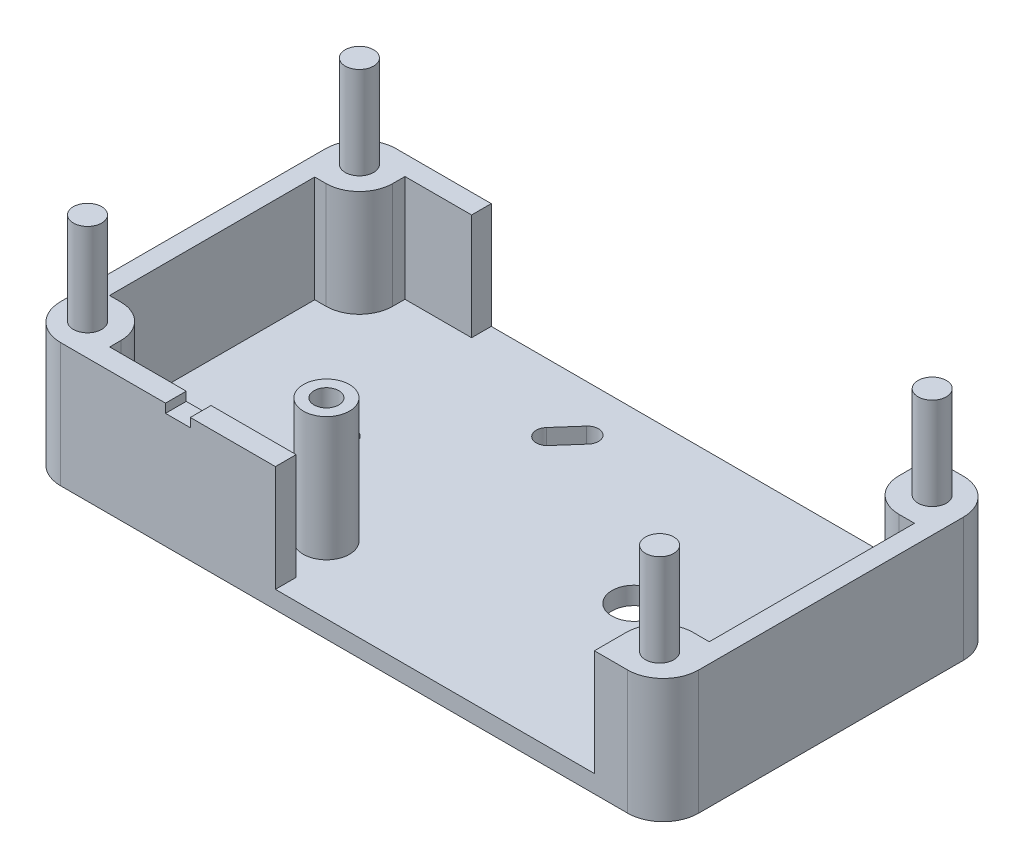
ISO-10303-21;
HEADER;
FILE_DESCRIPTION(('STEP AP214'),'2;1');
FILE_NAME('part.step','',(''),(''),'','','');
FILE_SCHEMA(('AUTOMOTIVE_DESIGN { 1 0 10303 214 1 1 1 1 }'));
ENDSEC;
DATA;
#1=APPLICATION_CONTEXT('core data for automotive mechanical design processes');
#2=APPLICATION_PROTOCOL_DEFINITION('international standard','automotive_design',2000,#1);
#3=PRODUCT_CONTEXT('',#1,'mechanical');
#4=PRODUCT('Part','Part','',(#3));
#5=PRODUCT_RELATED_PRODUCT_CATEGORY('part','',(#4));
#6=PRODUCT_DEFINITION_FORMATION('','',#4);
#7=PRODUCT_DEFINITION_CONTEXT('part definition',#1,'design');
#8=PRODUCT_DEFINITION('design','',#6,#7);
#9=PRODUCT_DEFINITION_SHAPE('','',#8);
#10=(LENGTH_UNIT() NAMED_UNIT(*) SI_UNIT(.MILLI.,.METRE.));
#11=(NAMED_UNIT(*) PLANE_ANGLE_UNIT() SI_UNIT($,.RADIAN.));
#12=(NAMED_UNIT(*) SI_UNIT($,.STERADIAN.) SOLID_ANGLE_UNIT());
#13=UNCERTAINTY_MEASURE_WITH_UNIT(LENGTH_MEASURE(1.E-05),#10,'distance_accuracy_value','');
#14=(GEOMETRIC_REPRESENTATION_CONTEXT(3) GLOBAL_UNCERTAINTY_ASSIGNED_CONTEXT((#13)) GLOBAL_UNIT_ASSIGNED_CONTEXT((#10,
#11,#12)) REPRESENTATION_CONTEXT('',''));
#15=CARTESIAN_POINT('',(0.,0.,0.));
#16=DIRECTION('',(0.,0.,1.));
#17=DIRECTION('',(1.,0.,0.));
#18=AXIS2_PLACEMENT_3D('',#15,#16,#17);
#19=CARTESIAN_POINT('',(0.,8.89,0.));
#20=DIRECTION('',(0.,1.,0.));
#21=DIRECTION('',(0.,0.,1.));
#22=AXIS2_PLACEMENT_3D('',#19,#20,#21);
#23=PLANE('',#22);
#24=DIRECTION('',(0.,0.,1.));
#25=VECTOR('',#24,1.);
#26=CARTESIAN_POINT('',(-12.8016000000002,8.89,-14.6431000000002));
#27=LINE('',#26,#25);
#28=CARTESIAN_POINT('',(-12.8016000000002,8.89,10.5409999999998));
#29=VERTEX_POINT('',#28);
#30=CARTESIAN_POINT('',(-12.8016000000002,8.89,12.0268999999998));
#31=VERTEX_POINT('',#30);
#32=EDGE_CURVE('E347',#29,#31,#27,.T.);
#33=ORIENTED_EDGE('',*,*,#32,.F.);
#34=DIRECTION('',(1.,0.,0.));
#35=VECTOR('',#34,1.);
#36=CARTESIAN_POINT('',(-18.2880000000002,8.89,10.5409999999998));
#37=LINE('',#36,#35);
#38=CARTESIAN_POINT('',(-18.2880000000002,8.89,10.5409999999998));
#39=VERTEX_POINT('',#38);
#40=EDGE_CURVE('E409',#39,#29,#37,.T.);
#41=ORIENTED_EDGE('',*,*,#40,.F.);
#42=DIRECTION('',(0.,0.,1.));
#43=VECTOR('',#42,1.);
#44=CARTESIAN_POINT('',(-18.2880000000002,8.89,-10.6172000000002));
#45=LINE('',#44,#43);
#46=CARTESIAN_POINT('',(-18.2880000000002,8.89,9.74090000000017));
#47=VERTEX_POINT('',#46);
#48=EDGE_CURVE('E388',#47,#39,#45,.T.);
#49=ORIENTED_EDGE('',*,*,#48,.F.);
#50=CARTESIAN_POINT('',(-20.6756000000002,8.89,9.74090000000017));
#51=DIRECTION('',(0.,1.,0.));
#52=DIRECTION('',(0.,0.,1.));
#53=AXIS2_PLACEMENT_3D('',#50,#51,#52);
#54=CIRCLE('',#53,2.3876);
#55=CARTESIAN_POINT('',(-20.6756000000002,8.89,7.35330000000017));
#56=VERTEX_POINT('',#55);
#57=EDGE_CURVE('E649',#47,#56,#54,.T.);
#58=ORIENTED_EDGE('',*,*,#57,.T.);
#59=DIRECTION('',(1.,0.,0.));
#60=VECTOR('',#59,1.);
#61=CARTESIAN_POINT('',(-21.4884000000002,8.89,7.35330000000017));
#62=LINE('',#61,#60);
#63=CARTESIAN_POINT('',(-21.4884000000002,8.89,7.35330000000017));
#64=VERTEX_POINT('',#63);
#65=EDGE_CURVE('E478',#64,#56,#62,.T.);
#66=ORIENTED_EDGE('',*,*,#65,.F.);
#67=DIRECTION('',(0.,0.,1.));
#68=VECTOR('',#67,1.);
#69=CARTESIAN_POINT('',(-21.4884000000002,8.89,-7.35330000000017));
#70=LINE('',#69,#68);
#71=CARTESIAN_POINT('',(-21.4884000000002,8.89,-7.35330000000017));
#72=VERTEX_POINT('',#71);
#73=EDGE_CURVE('E500',#72,#64,#70,.T.);
#74=ORIENTED_EDGE('',*,*,#73,.F.);
#75=DIRECTION('',(-1.,0.,0.));
#76=VECTOR('',#75,1.);
#77=CARTESIAN_POINT('',(-21.4884000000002,8.89,-7.35330000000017));
#78=LINE('',#77,#76);
#79=CARTESIAN_POINT('',(-20.6756000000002,8.89,-7.35330000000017));
#80=VERTEX_POINT('',#79);
#81=EDGE_CURVE('E495',#80,#72,#78,.T.);
#82=ORIENTED_EDGE('',*,*,#81,.F.);
#83=CARTESIAN_POINT('',(-20.6756000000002,8.89,-9.74090000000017));
#84=DIRECTION('',(0.,1.,0.));
#85=DIRECTION('',(0.,0.,1.));
#86=AXIS2_PLACEMENT_3D('',#83,#84,#85);
#87=CIRCLE('',#86,2.3876);
#88=CARTESIAN_POINT('',(-18.2880000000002,8.89,-9.74090000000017));
#89=VERTEX_POINT('',#88);
#90=EDGE_CURVE('E652',#80,#89,#87,.T.);
#91=ORIENTED_EDGE('',*,*,#90,.T.);
#92=CARTESIAN_POINT('',(-18.2880000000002,8.89,-10.6172000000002));
#93=VERTEX_POINT('',#92);
#94=EDGE_CURVE('E404',#93,#89,#45,.T.);
#95=ORIENTED_EDGE('',*,*,#94,.F.);
#96=DIRECTION('',(-1.,0.,0.));
#97=VECTOR('',#96,1.);
#98=CARTESIAN_POINT('',(-18.2880000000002,8.89,-10.6172000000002));
#99=LINE('',#98,#97);
#100=CARTESIAN_POINT('',(-13.5128000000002,8.89,-10.6172000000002));
#101=VERTEX_POINT('',#100);
#102=EDGE_CURVE('E413',#101,#93,#99,.T.);
#103=ORIENTED_EDGE('',*,*,#102,.F.);
#104=DIRECTION('',(0.,0.,-1.));
#105=VECTOR('',#104,1.);
#106=CARTESIAN_POINT('',(-13.5128000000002,8.89,-4.66090000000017));
#107=LINE('',#106,#105);
#108=CARTESIAN_POINT('',(-13.5128000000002,8.89,-12.0269000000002));
#109=VERTEX_POINT('',#108);
#110=EDGE_CURVE('E440',#101,#109,#107,.T.);
#111=ORIENTED_EDGE('',*,*,#110,.T.);
#112=DIRECTION('',(-1.,0.,0.));
#113=VECTOR('',#112,1.);
#114=CARTESIAN_POINT('',(-22.8600000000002,8.89,-12.0269000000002));
#115=LINE('',#114,#113);
#116=CARTESIAN_POINT('',(-20.3200000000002,8.89,-12.0269000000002));
#117=VERTEX_POINT('',#116);
#118=EDGE_CURVE('E527',#109,#117,#115,.T.);
#119=ORIENTED_EDGE('',*,*,#118,.T.);
#120=CARTESIAN_POINT('',(-20.3200000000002,8.89,-9.48690000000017));
#121=DIRECTION('',(0.,1.,0.));
#122=DIRECTION('',(0.,0.,1.));
#123=AXIS2_PLACEMENT_3D('',#120,#121,#122);
#124=CIRCLE('',#123,2.54);
#125=CARTESIAN_POINT('',(-22.8600000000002,8.89,-9.48690000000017));
#126=VERTEX_POINT('',#125);
#127=EDGE_CURVE('E590',#117,#126,#124,.T.);
#128=ORIENTED_EDGE('',*,*,#127,.T.);
#129=DIRECTION('',(0.,0.,1.));
#130=VECTOR('',#129,1.);
#131=CARTESIAN_POINT('',(-22.8600000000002,8.89,-12.0269000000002));
#132=LINE('',#131,#130);
#133=CARTESIAN_POINT('',(-22.8600000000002,8.89,9.48689999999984));
#134=VERTEX_POINT('',#133);
#135=EDGE_CURVE('E533',#126,#134,#132,.T.);
#136=ORIENTED_EDGE('',*,*,#135,.T.);
#137=CARTESIAN_POINT('',(-20.3200000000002,8.89,9.48689999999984));
#138=DIRECTION('',(0.,1.,0.));
#139=DIRECTION('',(0.,0.,1.));
#140=AXIS2_PLACEMENT_3D('',#137,#138,#139);
#141=CIRCLE('',#140,2.54);
#142=CARTESIAN_POINT('',(-20.3200000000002,8.89,12.0268999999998));
#143=VERTEX_POINT('',#142);
#144=EDGE_CURVE('E587',#134,#143,#141,.T.);
#145=ORIENTED_EDGE('',*,*,#144,.T.);
#146=DIRECTION('',(1.,0.,0.));
#147=VECTOR('',#146,1.);
#148=CARTESIAN_POINT('',(-22.8600000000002,8.89,12.0268999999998));
#149=LINE('',#148,#147);
#150=EDGE_CURVE('E538',#143,#31,#149,.T.);
#151=ORIENTED_EDGE('',*,*,#150,.T.);
#152=EDGE_LOOP('',(#33,#41,#49,#58,#66,#74,#82,#91,#95,#103,#111,#119,#128,#136,#145,#151));
#153=FACE_BOUND('',#152,.T.);
#154=CARTESIAN_POINT('',(-20.6756000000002,8.89,9.74090000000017));
#155=DIRECTION('',(0.,1.,0.));
#156=DIRECTION('',(0.,0.,1.));
#157=AXIS2_PLACEMENT_3D('',#154,#155,#156);
#158=CIRCLE('',#157,1.016);
#159=CARTESIAN_POINT('',(-20.6756000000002,8.89,8.72490000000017));
#160=VERTEX_POINT('',#159);
#161=EDGE_CURVE('E376',#160,#160,#158,.T.);
#162=ORIENTED_EDGE('',*,*,#161,.F.);
#163=EDGE_LOOP('',(#162));
#164=FACE_BOUND('',#163,.T.);
#165=CARTESIAN_POINT('',(-20.6756000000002,8.89,-9.74090000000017));
#166=DIRECTION('',(0.,1.,0.));
#167=DIRECTION('',(0.,0.,1.));
#168=AXIS2_PLACEMENT_3D('',#165,#166,#167);
#169=CIRCLE('',#168,1.016);
#170=CARTESIAN_POINT('',(-20.6756000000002,8.89,-10.7569000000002));
#171=VERTEX_POINT('',#170);
#172=EDGE_CURVE('E380',#171,#171,#169,.T.);
#173=ORIENTED_EDGE('',*,*,#172,.F.);
#174=EDGE_LOOP('',(#173));
#175=FACE_BOUND('',#174,.T.);
#176=ADVANCED_FACE('F44',(#153,#164,#175),#23,.T.);
#177=CARTESIAN_POINT('',(20.3199999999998,8.89,9.74090000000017));
#178=DIRECTION('',(0.,1.,0.));
#179=DIRECTION('',(0.,0.,1.));
#180=AXIS2_PLACEMENT_3D('',#177,#178,#179);
#181=CIRCLE('',#180,1.016);
#182=CARTESIAN_POINT('',(20.3199999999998,8.89,8.72490000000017));
#183=VERTEX_POINT('',#182);
#184=EDGE_CURVE('E360',#183,#183,#181,.T.);
#185=ORIENTED_EDGE('',*,*,#184,.F.);
#186=EDGE_LOOP('',(#185));
#187=FACE_BOUND('',#186,.T.);
#188=CARTESIAN_POINT('',(20.3707999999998,8.89,-9.74090000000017));
#189=DIRECTION('',(0.,1.,0.));
#190=DIRECTION('',(0.,0.,1.));
#191=AXIS2_PLACEMENT_3D('',#188,#189,#190);
#192=CIRCLE('',#191,1.016);
#193=CARTESIAN_POINT('',(20.3707999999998,8.89,-10.7569000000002));
#194=VERTEX_POINT('',#193);
#195=EDGE_CURVE('E368',#194,#194,#192,.T.);
#196=ORIENTED_EDGE('',*,*,#195,.F.);
#197=EDGE_LOOP('',(#196));
#198=FACE_BOUND('',#197,.T.);
#199=CARTESIAN_POINT('',(20.3199999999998,8.89,7.35330000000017));
#200=VERTEX_POINT('',#199);
#201=CARTESIAN_POINT('',(21.4884000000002,8.89,7.35330000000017));
#202=VERTEX_POINT('',#201);
#203=EDGE_CURVE('E504',#200,#202,#62,.T.);
#204=ORIENTED_EDGE('',*,*,#203,.F.);
#205=CARTESIAN_POINT('',(20.3199999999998,8.89,9.74090000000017));
#206=DIRECTION('',(0.,1.,0.));
#207=DIRECTION('',(0.,0.,1.));
#208=AXIS2_PLACEMENT_3D('',#205,#206,#207);
#209=CIRCLE('',#208,2.3876);
#210=CARTESIAN_POINT('',(17.9323999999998,8.89,9.74090000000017));
#211=VERTEX_POINT('',#210);
#212=EDGE_CURVE('E618',#200,#211,#209,.T.);
#213=ORIENTED_EDGE('',*,*,#212,.T.);
#214=DIRECTION('',(0.,0.,1.));
#215=VECTOR('',#214,1.);
#216=CARTESIAN_POINT('',(17.9323999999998,8.89,4.66089999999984));
#217=LINE('',#216,#215);
#218=CARTESIAN_POINT('',(17.9323999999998,8.89,12.0268999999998));
#219=VERTEX_POINT('',#218);
#220=EDGE_CURVE('E465',#211,#219,#217,.T.);
#221=ORIENTED_EDGE('',*,*,#220,.T.);
#222=CARTESIAN_POINT('',(20.3199999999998,8.89,12.0268999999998));
#223=VERTEX_POINT('',#222);
#224=EDGE_CURVE('E537',#219,#223,#149,.T.);
#225=ORIENTED_EDGE('',*,*,#224,.T.);
#226=CARTESIAN_POINT('',(20.3199999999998,8.89,9.48689999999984));
#227=DIRECTION('',(0.,1.,0.));
#228=DIRECTION('',(0.,0.,1.));
#229=AXIS2_PLACEMENT_3D('',#226,#227,#228);
#230=CIRCLE('',#229,2.54);
#231=CARTESIAN_POINT('',(22.8599999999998,8.89,9.48689999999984));
#232=VERTEX_POINT('',#231);
#233=EDGE_CURVE('E584',#223,#232,#230,.T.);
#234=ORIENTED_EDGE('',*,*,#233,.T.);
#235=DIRECTION('',(0.,0.,-1.));
#236=VECTOR('',#235,1.);
#237=CARTESIAN_POINT('',(22.8599999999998,8.89,-12.0269000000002));
#238=LINE('',#237,#236);
#239=CARTESIAN_POINT('',(22.8599999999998,8.89,-9.48690000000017));
#240=VERTEX_POINT('',#239);
#241=EDGE_CURVE('E523',#232,#240,#238,.T.);
#242=ORIENTED_EDGE('',*,*,#241,.T.);
#243=CARTESIAN_POINT('',(20.3199999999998,8.89,-9.48690000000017));
#244=DIRECTION('',(0.,1.,0.));
#245=DIRECTION('',(0.,0.,1.));
#246=AXIS2_PLACEMENT_3D('',#243,#244,#245);
#247=CIRCLE('',#246,2.54);
#248=CARTESIAN_POINT('',(20.3199999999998,8.89,-12.0269000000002));
#249=VERTEX_POINT('',#248);
#250=EDGE_CURVE('E593',#240,#249,#247,.T.);
#251=ORIENTED_EDGE('',*,*,#250,.T.);
#252=CARTESIAN_POINT('',(17.9831999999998,8.89,-12.0269000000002));
#253=VERTEX_POINT('',#252);
#254=EDGE_CURVE('E529',#249,#253,#115,.T.);
#255=ORIENTED_EDGE('',*,*,#254,.T.);
#256=DIRECTION('',(0.,0.,-1.));
#257=VECTOR('',#256,1.);
#258=CARTESIAN_POINT('',(17.9831999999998,8.89,-4.66090000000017));
#259=LINE('',#258,#257);
#260=CARTESIAN_POINT('',(17.9831999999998,8.89,-9.74090000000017));
#261=VERTEX_POINT('',#260);
#262=EDGE_CURVE('E436',#261,#253,#259,.T.);
#263=ORIENTED_EDGE('',*,*,#262,.F.);
#264=CARTESIAN_POINT('',(20.3707999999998,8.89,-9.74090000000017));
#265=DIRECTION('',(0.,1.,0.));
#266=DIRECTION('',(0.,0.,1.));
#267=AXIS2_PLACEMENT_3D('',#264,#265,#266);
#268=CIRCLE('',#267,2.3876);
#269=CARTESIAN_POINT('',(20.3707999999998,8.89,-7.35330000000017));
#270=VERTEX_POINT('',#269);
#271=EDGE_CURVE('E615',#261,#270,#268,.T.);
#272=ORIENTED_EDGE('',*,*,#271,.T.);
#273=CARTESIAN_POINT('',(21.4884000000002,8.89,-7.35330000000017));
#274=VERTEX_POINT('',#273);
#275=EDGE_CURVE('E496',#274,#270,#78,.T.);
#276=ORIENTED_EDGE('',*,*,#275,.F.);
#277=DIRECTION('',(0.,0.,-1.));
#278=VECTOR('',#277,1.);
#279=CARTESIAN_POINT('',(21.4884000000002,8.89,-7.35330000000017));
#280=LINE('',#279,#278);
#281=EDGE_CURVE('E464',#202,#274,#280,.T.);
#282=ORIENTED_EDGE('',*,*,#281,.F.);
#283=EDGE_LOOP('',(#204,#213,#221,#225,#234,#242,#251,#255,#263,#272,#276,#282));
#284=FACE_BOUND('',#283,.T.);
#285=ADVANCED_FACE('F726',(#187,#198,#284),#23,.T.);
#286=CARTESIAN_POINT('',(-21.4884000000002,1.27,-7.35330000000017));
#287=DIRECTION('',(0.,0.,-1.));
#288=DIRECTION('',(-1.,0.,0.));
#289=AXIS2_PLACEMENT_3D('',#286,#287,#288);
#290=PLANE('',#289);
#291=ORIENTED_EDGE('',*,*,#275,.T.);
#292=DIRECTION('',(0.,-1.,0.));
#293=VECTOR('',#292,1.);
#294=CARTESIAN_POINT('',(20.3707999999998,1.27,-7.35330000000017));
#295=LINE('',#294,#293);
#296=CARTESIAN_POINT('',(20.3707999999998,1.27,-7.35330000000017));
#297=VERTEX_POINT('',#296);
#298=EDGE_CURVE('E624',#270,#297,#295,.T.);
#299=ORIENTED_EDGE('',*,*,#298,.T.);
#300=DIRECTION('',(-1.,0.,0.));
#301=VECTOR('',#300,1.);
#302=CARTESIAN_POINT('',(-21.4884000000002,1.27,-7.35330000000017));
#303=LINE('',#302,#301);
#304=CARTESIAN_POINT('',(21.4884000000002,1.27,-7.35330000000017));
#305=VERTEX_POINT('',#304);
#306=EDGE_CURVE('E479',#305,#297,#303,.T.);
#307=ORIENTED_EDGE('',*,*,#306,.F.);
#308=DIRECTION('',(0.,1.,0.));
#309=VECTOR('',#308,1.);
#310=CARTESIAN_POINT('',(21.4884000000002,1.27,-7.35330000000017));
#311=LINE('',#310,#309);
#312=EDGE_CURVE('E492',#305,#274,#311,.T.);
#313=ORIENTED_EDGE('',*,*,#312,.T.);
#314=EDGE_LOOP('',(#291,#299,#307,#313));
#315=FACE_BOUND('',#314,.T.);
#316=ADVANCED_FACE('F733',(#315),#290,.F.);
#317=CARTESIAN_POINT('',(-21.4884000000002,1.27,7.35330000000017));
#318=DIRECTION('',(0.,0.,1.));
#319=DIRECTION('',(1.,0.,0.));
#320=AXIS2_PLACEMENT_3D('',#317,#318,#319);
#321=PLANE('',#320);
#322=ORIENTED_EDGE('',*,*,#65,.T.);
#323=DIRECTION('',(0.,-1.,0.));
#324=VECTOR('',#323,1.);
#325=CARTESIAN_POINT('',(-20.6756000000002,1.27,7.35330000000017));
#326=LINE('',#325,#324);
#327=CARTESIAN_POINT('',(-20.6756000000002,1.27,7.35330000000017));
#328=VERTEX_POINT('',#327);
#329=EDGE_CURVE('E658',#56,#328,#326,.T.);
#330=ORIENTED_EDGE('',*,*,#329,.T.);
#331=DIRECTION('',(1.,0.,0.));
#332=VECTOR('',#331,1.);
#333=CARTESIAN_POINT('',(-21.4884000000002,1.27,7.35330000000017));
#334=LINE('',#333,#332);
#335=CARTESIAN_POINT('',(-21.4884000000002,1.27,7.35330000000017));
#336=VERTEX_POINT('',#335);
#337=EDGE_CURVE('E488',#336,#328,#334,.T.);
#338=ORIENTED_EDGE('',*,*,#337,.F.);
#339=DIRECTION('',(0.,1.,0.));
#340=VECTOR('',#339,1.);
#341=CARTESIAN_POINT('',(-21.4884000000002,1.27,7.35330000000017));
#342=LINE('',#341,#340);
#343=EDGE_CURVE('E513',#336,#64,#342,.T.);
#344=ORIENTED_EDGE('',*,*,#343,.T.);
#345=EDGE_LOOP('',(#322,#330,#338,#344));
#346=FACE_BOUND('',#345,.T.);
#347=ADVANCED_FACE('F760',(#346),#321,.F.);
#348=CARTESIAN_POINT('',(22.8599999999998,8.89,-12.0269000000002));
#349=DIRECTION('',(-1.,0.,0.));
#350=DIRECTION('',(0.,0.,1.));
#351=AXIS2_PLACEMENT_3D('',#348,#349,#350);
#352=PLANE('',#351);
#353=DIRECTION('',(0.,0.,-1.));
#354=VECTOR('',#353,1.);
#355=CARTESIAN_POINT('',(22.8599999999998,0.,-12.0269000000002));
#356=LINE('',#355,#354);
#357=CARTESIAN_POINT('',(22.8599999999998,0.,9.48689999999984));
#358=VERTEX_POINT('',#357);
#359=CARTESIAN_POINT('',(22.8599999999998,0.,-9.48690000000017));
#360=VERTEX_POINT('',#359);
#361=EDGE_CURVE('E512',#358,#360,#356,.T.);
#362=ORIENTED_EDGE('',*,*,#361,.T.);
#363=DIRECTION('',(0.,-1.,0.));
#364=VECTOR('',#363,1.);
#365=CARTESIAN_POINT('',(22.8599999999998,8.89,-9.48690000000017));
#366=LINE('',#365,#364);
#367=EDGE_CURVE('E581',#360,#240,#366,.F.);
#368=ORIENTED_EDGE('',*,*,#367,.T.);
#369=ORIENTED_EDGE('',*,*,#241,.F.);
#370=DIRECTION('',(0.,-1.,0.));
#371=VECTOR('',#370,1.);
#372=CARTESIAN_POINT('',(22.8599999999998,8.89,9.48689999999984));
#373=LINE('',#372,#371);
#374=EDGE_CURVE('E577',#232,#358,#373,.T.);
#375=ORIENTED_EDGE('',*,*,#374,.T.);
#376=EDGE_LOOP('',(#362,#368,#369,#375));
#377=FACE_BOUND('',#376,.T.);
#378=ADVANCED_FACE('F756',(#377),#352,.F.);
#379=CARTESIAN_POINT('',(-22.8600000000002,8.89,-12.0269000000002));
#380=DIRECTION('',(0.,0.,1.));
#381=DIRECTION('',(1.,0.,0.));
#382=AXIS2_PLACEMENT_3D('',#379,#380,#381);
#383=PLANE('',#382);
#384=DIRECTION('',(-1.,0.,0.));
#385=VECTOR('',#384,1.);
#386=CARTESIAN_POINT('',(17.9831999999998,1.27,-12.0269000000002));
#387=LINE('',#386,#385);
#388=CARTESIAN_POINT('',(17.9831999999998,1.27,-12.0269000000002));
#389=VERTEX_POINT('',#388);
#390=CARTESIAN_POINT('',(-13.5128000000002,1.27,-12.0269000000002));
#391=VERTEX_POINT('',#390);
#392=EDGE_CURVE('E427',#389,#391,#387,.T.);
#393=ORIENTED_EDGE('',*,*,#392,.F.);
#394=DIRECTION('',(0.,-1.,0.));
#395=VECTOR('',#394,1.);
#396=CARTESIAN_POINT('',(17.9831999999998,8.89,-12.0269000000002));
#397=LINE('',#396,#395);
#398=EDGE_CURVE('E420',#253,#389,#397,.T.);
#399=ORIENTED_EDGE('',*,*,#398,.F.);
#400=ORIENTED_EDGE('',*,*,#254,.F.);
#401=DIRECTION('',(0.,-1.,0.));
#402=VECTOR('',#401,1.);
#403=CARTESIAN_POINT('',(20.3199999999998,8.89,-12.0269000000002));
#404=LINE('',#403,#402);
#405=CARTESIAN_POINT('',(20.3199999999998,0.,-12.0269000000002));
#406=VERTEX_POINT('',#405);
#407=EDGE_CURVE('E561',#249,#406,#404,.T.);
#408=ORIENTED_EDGE('',*,*,#407,.T.);
#409=DIRECTION('',(-1.,0.,0.));
#410=VECTOR('',#409,1.);
#411=CARTESIAN_POINT('',(-22.8600000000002,0.,-12.0269000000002));
#412=LINE('',#411,#410);
#413=CARTESIAN_POINT('',(-20.3200000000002,0.,-12.0269000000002));
#414=VERTEX_POINT('',#413);
#415=EDGE_CURVE('E547',#406,#414,#412,.T.);
#416=ORIENTED_EDGE('',*,*,#415,.T.);
#417=DIRECTION('',(0.,-1.,0.));
#418=VECTOR('',#417,1.);
#419=CARTESIAN_POINT('',(-20.3200000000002,8.89,-12.0269000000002));
#420=LINE('',#419,#418);
#421=EDGE_CURVE('E542',#414,#117,#420,.F.);
#422=ORIENTED_EDGE('',*,*,#421,.T.);
#423=ORIENTED_EDGE('',*,*,#118,.F.);
#424=DIRECTION('',(0.,1.,0.));
#425=VECTOR('',#424,1.);
#426=CARTESIAN_POINT('',(-13.5128000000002,1.27,-12.0269000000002));
#427=LINE('',#426,#425);
#428=EDGE_CURVE('E431',#391,#109,#427,.T.);
#429=ORIENTED_EDGE('',*,*,#428,.F.);
#430=EDGE_LOOP('',(#393,#399,#400,#408,#416,#422,#423,#429));
#431=FACE_BOUND('',#430,.T.);
#432=ADVANCED_FACE('F750',(#431),#383,.F.);
#433=CARTESIAN_POINT('',(-22.8600000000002,8.89,-12.0269000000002));
#434=DIRECTION('',(1.,0.,0.));
#435=DIRECTION('',(0.,0.,-1.));
#436=AXIS2_PLACEMENT_3D('',#433,#434,#435);
#437=PLANE('',#436);
#438=ORIENTED_EDGE('',*,*,#135,.F.);
#439=DIRECTION('',(0.,-1.,0.));
#440=VECTOR('',#439,1.);
#441=CARTESIAN_POINT('',(-22.8600000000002,8.89,-9.48690000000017));
#442=LINE('',#441,#440);
#443=CARTESIAN_POINT('',(-22.8600000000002,0.,-9.48690000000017));
#444=VERTEX_POINT('',#443);
#445=EDGE_CURVE('E599',#126,#444,#442,.T.);
#446=ORIENTED_EDGE('',*,*,#445,.T.);
#447=DIRECTION('',(0.,0.,1.));
#448=VECTOR('',#447,1.);
#449=CARTESIAN_POINT('',(-22.8600000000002,0.,-12.0269000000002));
#450=LINE('',#449,#448);
#451=CARTESIAN_POINT('',(-22.8600000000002,0.,9.48689999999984));
#452=VERTEX_POINT('',#451);
#453=EDGE_CURVE('E551',#444,#452,#450,.T.);
#454=ORIENTED_EDGE('',*,*,#453,.T.);
#455=DIRECTION('',(0.,-1.,0.));
#456=VECTOR('',#455,1.);
#457=CARTESIAN_POINT('',(-22.8600000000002,8.89,9.48689999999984));
#458=LINE('',#457,#456);
#459=EDGE_CURVE('E596',#452,#134,#458,.F.);
#460=ORIENTED_EDGE('',*,*,#459,.T.);
#461=EDGE_LOOP('',(#438,#446,#454,#460));
#462=FACE_BOUND('',#461,.T.);
#463=ADVANCED_FACE('F745',(#462),#437,.F.);
#464=CARTESIAN_POINT('',(-22.8600000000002,8.89,12.0268999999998));
#465=DIRECTION('',(0.,0.,-1.));
#466=DIRECTION('',(-1.,0.,0.));
#467=AXIS2_PLACEMENT_3D('',#464,#465,#466);
#468=PLANE('',#467);
#469=DIRECTION('',(1.,0.,0.));
#470=VECTOR('',#469,1.);
#471=CARTESIAN_POINT('',(-12.8016000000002,8.255,12.0268999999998));
#472=LINE('',#471,#470);
#473=CARTESIAN_POINT('',(-12.8016000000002,8.255,12.0268999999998));
#474=VERTEX_POINT('',#473);
#475=CARTESIAN_POINT('',(-11.0236000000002,8.255,12.0268999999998));
#476=VERTEX_POINT('',#475);
#477=EDGE_CURVE('E339',#474,#476,#472,.T.);
#478=ORIENTED_EDGE('',*,*,#477,.F.);
#479=DIRECTION('',(0.,-1.,0.));
#480=VECTOR('',#479,1.);
#481=CARTESIAN_POINT('',(-12.8016000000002,8.89,12.0268999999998));
#482=LINE('',#481,#480);
#483=EDGE_CURVE('E335',#31,#474,#482,.T.);
#484=ORIENTED_EDGE('',*,*,#483,.F.);
#485=ORIENTED_EDGE('',*,*,#150,.F.);
#486=DIRECTION('',(0.,-1.,0.));
#487=VECTOR('',#486,1.);
#488=CARTESIAN_POINT('',(-20.3200000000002,8.89,12.0268999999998));
#489=LINE('',#488,#487);
#490=CARTESIAN_POINT('',(-20.3200000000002,0.,12.0268999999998));
#491=VERTEX_POINT('',#490);
#492=EDGE_CURVE('E607',#143,#491,#489,.T.);
#493=ORIENTED_EDGE('',*,*,#492,.T.);
#494=DIRECTION('',(1.,0.,0.));
#495=VECTOR('',#494,1.);
#496=CARTESIAN_POINT('',(-22.8600000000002,0.,12.0268999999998));
#497=LINE('',#496,#495);
#498=CARTESIAN_POINT('',(20.3199999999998,0.,12.0268999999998));
#499=VERTEX_POINT('',#498);
#500=EDGE_CURVE('E528',#491,#499,#497,.T.);
#501=ORIENTED_EDGE('',*,*,#500,.T.);
#502=DIRECTION('',(0.,-1.,0.));
#503=VECTOR('',#502,1.);
#504=CARTESIAN_POINT('',(20.3199999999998,8.89,12.0268999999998));
#505=LINE('',#504,#503);
#506=EDGE_CURVE('E603',#499,#223,#505,.F.);
#507=ORIENTED_EDGE('',*,*,#506,.T.);
#508=ORIENTED_EDGE('',*,*,#224,.F.);
#509=DIRECTION('',(0.,1.,0.));
#510=VECTOR('',#509,1.);
#511=CARTESIAN_POINT('',(17.9323999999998,8.89,12.0268999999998));
#512=LINE('',#511,#510);
#513=CARTESIAN_POINT('',(17.9323999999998,1.27,12.0268999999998));
#514=VERTEX_POINT('',#513);
#515=EDGE_CURVE('E455',#514,#219,#512,.T.);
#516=ORIENTED_EDGE('',*,*,#515,.F.);
#517=DIRECTION('',(1.,0.,0.));
#518=VECTOR('',#517,1.);
#519=CARTESIAN_POINT('',(-4.92760000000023,1.27,12.0268999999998));
#520=LINE('',#519,#518);
#521=CARTESIAN_POINT('',(-4.92760000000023,1.27,12.0268999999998));
#522=VERTEX_POINT('',#521);
#523=EDGE_CURVE('E451',#522,#514,#520,.T.);
#524=ORIENTED_EDGE('',*,*,#523,.F.);
#525=DIRECTION('',(0.,-1.,0.));
#526=VECTOR('',#525,1.);
#527=CARTESIAN_POINT('',(-4.92760000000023,8.89,12.0268999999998));
#528=LINE('',#527,#526);
#529=CARTESIAN_POINT('',(-4.92760000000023,8.89,12.0268999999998));
#530=VERTEX_POINT('',#529);
#531=EDGE_CURVE('E439',#530,#522,#528,.T.);
#532=ORIENTED_EDGE('',*,*,#531,.F.);
#533=CARTESIAN_POINT('',(-11.0236000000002,8.89,12.0268999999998));
#534=VERTEX_POINT('',#533);
#535=EDGE_CURVE('E543',#534,#530,#149,.T.);
#536=ORIENTED_EDGE('',*,*,#535,.F.);
#537=DIRECTION('',(0.,1.,0.));
#538=VECTOR('',#537,1.);
#539=CARTESIAN_POINT('',(-11.0236000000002,8.89,12.0268999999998));
#540=LINE('',#539,#538);
#541=EDGE_CURVE('E343',#476,#534,#540,.T.);
#542=ORIENTED_EDGE('',*,*,#541,.F.);
#543=EDGE_LOOP('',(#478,#484,#485,#493,#501,#507,#508,#516,#524,#532,#536,#542));
#544=FACE_BOUND('',#543,.T.);
#545=ADVANCED_FACE('F708',(#544),#468,.F.);
#546=DIRECTION('',(0.,0.,1.));
#547=VECTOR('',#546,1.);
#548=CARTESIAN_POINT('',(-11.0236000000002,8.89,-14.6431000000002));
#549=LINE('',#548,#547);
#550=CARTESIAN_POINT('',(-11.0236000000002,8.89,10.5409999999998));
#551=VERTEX_POINT('',#550);
#552=EDGE_CURVE('E351',#551,#534,#549,.T.);
#553=ORIENTED_EDGE('',*,*,#552,.T.);
#554=ORIENTED_EDGE('',*,*,#535,.T.);
#555=DIRECTION('',(0.,0.,1.));
#556=VECTOR('',#555,1.);
#557=CARTESIAN_POINT('',(-4.92760000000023,8.89,4.66089999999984));
#558=LINE('',#557,#556);
#559=CARTESIAN_POINT('',(-4.92760000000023,8.89,10.5409999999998));
#560=VERTEX_POINT('',#559);
#561=EDGE_CURVE('E460',#560,#530,#558,.T.);
#562=ORIENTED_EDGE('',*,*,#561,.F.);
#563=EDGE_CURVE('E408',#551,#560,#37,.T.);
#564=ORIENTED_EDGE('',*,*,#563,.F.);
#565=EDGE_LOOP('',(#553,#554,#562,#564));
#566=FACE_BOUND('',#565,.T.);
#567=ADVANCED_FACE('F685',(#566),#23,.T.);
#568=CARTESIAN_POINT('',(0.,0.,0.));
#569=DIRECTION('',(0.,1.,0.));
#570=DIRECTION('',(0.,0.,1.));
#571=AXIS2_PLACEMENT_3D('',#568,#569,#570);
#572=PLANE('',#571);
#573=CARTESIAN_POINT('',(-6.09600000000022,0.,7.20089999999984));
#574=DIRECTION('',(0.,1.,0.));
#575=DIRECTION('',(0.,0.,1.));
#576=AXIS2_PLACEMENT_3D('',#573,#574,#575);
#577=CIRCLE('',#576,0.889);
#578=CARTESIAN_POINT('',(-6.09600000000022,0.,8.08989999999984));
#579=VERTEX_POINT('',#578);
#580=EDGE_CURVE('E48',#579,#579,#577,.T.);
#581=ORIENTED_EDGE('',*,*,#580,.T.);
#582=EDGE_LOOP('',(#581));
#583=FACE_BOUND('',#582,.T.);
#584=CARTESIAN_POINT('',(-11.959356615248,0.,0.0380999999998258));
#585=DIRECTION('',(0.,1.,0.));
#586=DIRECTION('',(0.,0.,1.));
#587=AXIS2_PLACEMENT_3D('',#584,#585,#586);
#588=CIRCLE('',#587,0.793749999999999);
#589=CARTESIAN_POINT('',(-11.959356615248,0.,0.831849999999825));
#590=VERTEX_POINT('',#589);
#591=EDGE_CURVE('E1284',#590,#590,#588,.T.);
#592=ORIENTED_EDGE('',*,*,#591,.T.);
#593=EDGE_LOOP('',(#592));
#594=FACE_BOUND('',#593,.T.);
#595=DIRECTION('',(-0.661437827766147,0.,0.75));
#596=VECTOR('',#595,1.);
#597=CARTESIAN_POINT('',(-6.7930037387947,0.,-5.99086618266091));
#598=LINE('',#597,#596);
#599=CARTESIAN_POINT('',(-3.91879171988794,0.,-9.24991627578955));
#600=VERTEX_POINT('',#599);
#601=CARTESIAN_POINT('',(-5.26283338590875,0.,-7.72591627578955));
#602=VERTEX_POINT('',#601);
#603=EDGE_CURVE('E319',#600,#602,#598,.T.);
#604=ORIENTED_EDGE('',*,*,#603,.T.);
#605=CARTESIAN_POINT('',(-4.66752088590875,0.,-7.20090000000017));
#606=DIRECTION('',(0.,1.,0.));
#607=DIRECTION('',(0.,0.,1.));
#608=AXIS2_PLACEMENT_3D('',#605,#606,#607);
#609=CIRCLE('',#608,0.79375);
#610=CARTESIAN_POINT('',(-4.07220838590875,0.,-6.6758837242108));
#611=VERTEX_POINT('',#610);
#612=EDGE_CURVE('E323',#602,#611,#609,.T.);
#613=ORIENTED_EDGE('',*,*,#612,.T.);
#614=DIRECTION('',(0.661437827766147,0.,-0.75));
#615=VECTOR('',#614,1.);
#616=CARTESIAN_POINT('',(-5.6023787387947,0.,-4.94083363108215));
#617=LINE('',#616,#615);
#618=CARTESIAN_POINT('',(-2.72816671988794,0.,-8.19988372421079));
#619=VERTEX_POINT('',#618);
#620=EDGE_CURVE('E310',#611,#619,#617,.T.);
#621=ORIENTED_EDGE('',*,*,#620,.T.);
#622=CARTESIAN_POINT('',(-3.32347921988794,0.,-8.72490000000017));
#623=DIRECTION('',(0.,1.,0.));
#624=DIRECTION('',(0.,0.,1.));
#625=AXIS2_PLACEMENT_3D('',#622,#623,#624);
#626=CIRCLE('',#625,0.79375);
#627=EDGE_CURVE('E285',#619,#600,#626,.T.);
#628=ORIENTED_EDGE('',*,*,#627,.T.);
#629=EDGE_LOOP('',(#604,#613,#621,#628));
#630=FACE_BOUND('',#629,.T.);
#631=CARTESIAN_POINT('',(8.78840000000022,0.,0.0380999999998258));
#632=DIRECTION('',(0.,1.,0.));
#633=DIRECTION('',(0.,0.,1.));
#634=AXIS2_PLACEMENT_3D('',#631,#632,#633);
#635=CIRCLE('',#634,1.5875);
#636=CARTESIAN_POINT('',(8.78840000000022,0.,1.62559999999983));
#637=VERTEX_POINT('',#636);
#638=EDGE_CURVE('E331',#637,#637,#635,.T.);
#639=ORIENTED_EDGE('',*,*,#638,.T.);
#640=EDGE_LOOP('',(#639));
#641=FACE_BOUND('',#640,.T.);
#642=ORIENTED_EDGE('',*,*,#415,.F.);
#643=CARTESIAN_POINT('',(20.3199999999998,0.,-9.48690000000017));
#644=DIRECTION('',(0.,1.,0.));
#645=DIRECTION('',(0.,0.,1.));
#646=AXIS2_PLACEMENT_3D('',#643,#644,#645);
#647=CIRCLE('',#646,2.54);
#648=EDGE_CURVE('E574',#406,#360,#647,.F.);
#649=ORIENTED_EDGE('',*,*,#648,.T.);
#650=ORIENTED_EDGE('',*,*,#361,.F.);
#651=CARTESIAN_POINT('',(20.3199999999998,0.,9.48689999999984));
#652=DIRECTION('',(0.,1.,0.));
#653=DIRECTION('',(0.,0.,1.));
#654=AXIS2_PLACEMENT_3D('',#651,#652,#653);
#655=CIRCLE('',#654,2.54);
#656=EDGE_CURVE('E565',#358,#499,#655,.F.);
#657=ORIENTED_EDGE('',*,*,#656,.T.);
#658=ORIENTED_EDGE('',*,*,#500,.F.);
#659=CARTESIAN_POINT('',(-20.3200000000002,0.,9.48689999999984));
#660=DIRECTION('',(0.,1.,0.));
#661=DIRECTION('',(0.,0.,1.));
#662=AXIS2_PLACEMENT_3D('',#659,#660,#661);
#663=CIRCLE('',#662,2.54);
#664=EDGE_CURVE('E568',#491,#452,#663,.F.);
#665=ORIENTED_EDGE('',*,*,#664,.T.);
#666=ORIENTED_EDGE('',*,*,#453,.F.);
#667=CARTESIAN_POINT('',(-20.3200000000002,0.,-9.48690000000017));
#668=DIRECTION('',(0.,1.,0.));
#669=DIRECTION('',(0.,0.,1.));
#670=AXIS2_PLACEMENT_3D('',#667,#668,#669);
#671=CIRCLE('',#670,2.54);
#672=EDGE_CURVE('E571',#444,#414,#671,.F.);
#673=ORIENTED_EDGE('',*,*,#672,.T.);
#674=EDGE_LOOP('',(#642,#649,#650,#657,#658,#665,#666,#673));
#675=FACE_BOUND('',#674,.T.);
#676=ADVANCED_FACE('F738',(#583,#594,#630,#641,#675),#572,.F.);
#677=CARTESIAN_POINT('',(20.3199999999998,8.89,-9.48690000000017));
#678=DIRECTION('',(0.,-1.,0.));
#679=DIRECTION('',(0.,0.,-1.));
#680=AXIS2_PLACEMENT_3D('',#677,#678,#679);
#681=CYLINDRICAL_SURFACE('',#680,2.54);
#682=ORIENTED_EDGE('',*,*,#250,.F.);
#683=ORIENTED_EDGE('',*,*,#367,.F.);
#684=ORIENTED_EDGE('',*,*,#648,.F.);
#685=ORIENTED_EDGE('',*,*,#407,.F.);
#686=EDGE_LOOP('',(#682,#683,#684,#685));
#687=FACE_BOUND('',#686,.T.);
#688=ADVANCED_FACE('F743',(#687),#681,.T.);
#689=CARTESIAN_POINT('',(-20.3200000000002,8.89,-9.48690000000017));
#690=DIRECTION('',(0.,-1.,0.));
#691=DIRECTION('',(0.,0.,-1.));
#692=AXIS2_PLACEMENT_3D('',#689,#690,#691);
#693=CYLINDRICAL_SURFACE('',#692,2.54);
#694=ORIENTED_EDGE('',*,*,#127,.F.);
#695=ORIENTED_EDGE('',*,*,#421,.F.);
#696=ORIENTED_EDGE('',*,*,#672,.F.);
#697=ORIENTED_EDGE('',*,*,#445,.F.);
#698=EDGE_LOOP('',(#694,#695,#696,#697));
#699=FACE_BOUND('',#698,.T.);
#700=ADVANCED_FACE('F764',(#699),#693,.T.);
#701=CARTESIAN_POINT('',(-20.3200000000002,8.89,9.48689999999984));
#702=DIRECTION('',(0.,-1.,0.));
#703=DIRECTION('',(0.,0.,-1.));
#704=AXIS2_PLACEMENT_3D('',#701,#702,#703);
#705=CYLINDRICAL_SURFACE('',#704,2.54);
#706=ORIENTED_EDGE('',*,*,#144,.F.);
#707=ORIENTED_EDGE('',*,*,#459,.F.);
#708=ORIENTED_EDGE('',*,*,#664,.F.);
#709=ORIENTED_EDGE('',*,*,#492,.F.);
#710=EDGE_LOOP('',(#706,#707,#708,#709));
#711=FACE_BOUND('',#710,.T.);
#712=ADVANCED_FACE('F768',(#711),#705,.T.);
#713=CARTESIAN_POINT('',(20.3199999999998,8.89,9.48689999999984));
#714=DIRECTION('',(0.,-1.,0.));
#715=DIRECTION('',(0.,0.,-1.));
#716=AXIS2_PLACEMENT_3D('',#713,#714,#715);
#717=CYLINDRICAL_SURFACE('',#716,2.54);
#718=ORIENTED_EDGE('',*,*,#233,.F.);
#719=ORIENTED_EDGE('',*,*,#506,.F.);
#720=ORIENTED_EDGE('',*,*,#656,.F.);
#721=ORIENTED_EDGE('',*,*,#374,.F.);
#722=EDGE_LOOP('',(#718,#719,#720,#721));
#723=FACE_BOUND('',#722,.T.);
#724=ADVANCED_FACE('F772',(#723),#717,.T.);
#725=CARTESIAN_POINT('',(21.4884000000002,1.27,-7.35330000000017));
#726=DIRECTION('',(1.,0.,0.));
#727=DIRECTION('',(0.,0.,-1.));
#728=AXIS2_PLACEMENT_3D('',#725,#726,#727);
#729=PLANE('',#728);
#730=ORIENTED_EDGE('',*,*,#281,.T.);
#731=ORIENTED_EDGE('',*,*,#312,.F.);
#732=DIRECTION('',(0.,0.,-1.));
#733=VECTOR('',#732,1.);
#734=CARTESIAN_POINT('',(21.4884000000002,1.27,-7.35330000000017));
#735=LINE('',#734,#733);
#736=CARTESIAN_POINT('',(21.4884000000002,1.27,7.35330000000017));
#737=VERTEX_POINT('',#736);
#738=EDGE_CURVE('E473',#737,#305,#735,.T.);
#739=ORIENTED_EDGE('',*,*,#738,.F.);
#740=DIRECTION('',(0.,1.,0.));
#741=VECTOR('',#740,1.);
#742=CARTESIAN_POINT('',(21.4884000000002,1.27,7.35330000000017));
#743=LINE('',#742,#741);
#744=EDGE_CURVE('E508',#737,#202,#743,.T.);
#745=ORIENTED_EDGE('',*,*,#744,.T.);
#746=EDGE_LOOP('',(#730,#731,#739,#745));
#747=FACE_BOUND('',#746,.T.);
#748=ADVANCED_FACE('F776',(#747),#729,.F.);
#749=CARTESIAN_POINT('',(20.3199999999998,1.27,7.35330000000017));
#750=VERTEX_POINT('',#749);
#751=EDGE_CURVE('E487',#750,#737,#334,.T.);
#752=ORIENTED_EDGE('',*,*,#751,.F.);
#753=DIRECTION('',(0.,1.,0.));
#754=VECTOR('',#753,1.);
#755=CARTESIAN_POINT('',(20.3199999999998,1.27,7.35330000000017));
#756=LINE('',#755,#754);
#757=EDGE_CURVE('E611',#750,#200,#756,.T.);
#758=ORIENTED_EDGE('',*,*,#757,.T.);
#759=ORIENTED_EDGE('',*,*,#203,.T.);
#760=ORIENTED_EDGE('',*,*,#744,.F.);
#761=EDGE_LOOP('',(#752,#758,#759,#760));
#762=FACE_BOUND('',#761,.T.);
#763=ADVANCED_FACE('F842',(#762),#321,.F.);
#764=CARTESIAN_POINT('',(-21.4884000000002,1.27,-7.35330000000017));
#765=DIRECTION('',(-1.,0.,0.));
#766=DIRECTION('',(0.,0.,1.));
#767=AXIS2_PLACEMENT_3D('',#764,#765,#766);
#768=PLANE('',#767);
#769=ORIENTED_EDGE('',*,*,#73,.T.);
#770=ORIENTED_EDGE('',*,*,#343,.F.);
#771=DIRECTION('',(0.,0.,1.));
#772=VECTOR('',#771,1.);
#773=CARTESIAN_POINT('',(-21.4884000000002,1.27,-7.35330000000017));
#774=LINE('',#773,#772);
#775=CARTESIAN_POINT('',(-21.4884000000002,1.27,-7.35330000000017));
#776=VERTEX_POINT('',#775);
#777=EDGE_CURVE('E483',#776,#336,#774,.T.);
#778=ORIENTED_EDGE('',*,*,#777,.F.);
#779=DIRECTION('',(0.,1.,0.));
#780=VECTOR('',#779,1.);
#781=CARTESIAN_POINT('',(-21.4884000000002,1.27,-7.35330000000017));
#782=LINE('',#781,#780);
#783=EDGE_CURVE('E516',#776,#72,#782,.T.);
#784=ORIENTED_EDGE('',*,*,#783,.T.);
#785=EDGE_LOOP('',(#769,#770,#778,#784));
#786=FACE_BOUND('',#785,.T.);
#787=ADVANCED_FACE('F818',(#786),#768,.F.);
#788=CARTESIAN_POINT('',(-20.6756000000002,1.27,-7.35330000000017));
#789=VERTEX_POINT('',#788);
#790=EDGE_CURVE('E477',#789,#776,#303,.T.);
#791=ORIENTED_EDGE('',*,*,#790,.F.);
#792=DIRECTION('',(0.,1.,0.));
#793=VECTOR('',#792,1.);
#794=CARTESIAN_POINT('',(-20.6756000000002,1.27,-7.35330000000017));
#795=LINE('',#794,#793);
#796=EDGE_CURVE('E645',#789,#80,#795,.T.);
#797=ORIENTED_EDGE('',*,*,#796,.T.);
#798=ORIENTED_EDGE('',*,*,#81,.T.);
#799=ORIENTED_EDGE('',*,*,#783,.F.);
#800=EDGE_LOOP('',(#791,#797,#798,#799));
#801=FACE_BOUND('',#800,.T.);
#802=ADVANCED_FACE('F805',(#801),#290,.F.);
#803=CARTESIAN_POINT('',(0.,1.27,0.));
#804=DIRECTION('',(0.,1.,0.));
#805=DIRECTION('',(0.,0.,1.));
#806=AXIS2_PLACEMENT_3D('',#803,#804,#805);
#807=PLANE('',#806);
#808=CARTESIAN_POINT('',(-6.09600000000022,1.27,7.20089999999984));
#809=DIRECTION('',(0.,1.,0.));
#810=DIRECTION('',(0.,0.,1.));
#811=AXIS2_PLACEMENT_3D('',#808,#809,#810);
#812=CIRCLE('',#811,1.651);
#813=CARTESIAN_POINT('',(-6.09600000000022,1.27,8.85189999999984));
#814=VERTEX_POINT('',#813);
#815=EDGE_CURVE('E1270',#814,#814,#812,.T.);
#816=ORIENTED_EDGE('',*,*,#815,.F.);
#817=EDGE_LOOP('',(#816));
#818=FACE_BOUND('',#817,.T.);
#819=CARTESIAN_POINT('',(-11.959356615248,1.27,0.0380999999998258));
#820=DIRECTION('',(0.,1.,0.));
#821=DIRECTION('',(0.,0.,1.));
#822=AXIS2_PLACEMENT_3D('',#819,#820,#821);
#823=CIRCLE('',#822,0.793749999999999);
#824=CARTESIAN_POINT('',(-11.959356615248,1.27,0.831849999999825));
#825=VERTEX_POINT('',#824);
#826=EDGE_CURVE('E1279',#825,#825,#823,.T.);
#827=ORIENTED_EDGE('',*,*,#826,.F.);
#828=EDGE_LOOP('',(#827));
#829=FACE_BOUND('',#828,.T.);
#830=CARTESIAN_POINT('',(-4.66752088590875,1.27,-7.20090000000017));
#831=DIRECTION('',(0.,1.,0.));
#832=DIRECTION('',(0.,0.,1.));
#833=AXIS2_PLACEMENT_3D('',#830,#831,#832);
#834=CIRCLE('',#833,0.79375);
#835=CARTESIAN_POINT('',(-5.26283338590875,1.27,-7.72591627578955));
#836=VERTEX_POINT('',#835);
#837=CARTESIAN_POINT('',(-4.07220838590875,1.27,-6.6758837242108));
#838=VERTEX_POINT('',#837);
#839=EDGE_CURVE('E69',#836,#838,#834,.T.);
#840=ORIENTED_EDGE('',*,*,#839,.F.);
#841=DIRECTION('',(-0.661437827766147,0.,0.75));
#842=VECTOR('',#841,1.);
#843=CARTESIAN_POINT('',(-5.26283338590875,1.27,-7.72591627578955));
#844=LINE('',#843,#842);
#845=CARTESIAN_POINT('',(-3.91879171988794,1.27,-9.24991627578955));
#846=VERTEX_POINT('',#845);
#847=EDGE_CURVE('E300',#846,#836,#844,.T.);
#848=ORIENTED_EDGE('',*,*,#847,.F.);
#849=CARTESIAN_POINT('',(-3.32347921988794,1.27,-8.72490000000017));
#850=DIRECTION('',(0.,1.,0.));
#851=DIRECTION('',(0.,0.,1.));
#852=AXIS2_PLACEMENT_3D('',#849,#850,#851);
#853=CIRCLE('',#852,0.79375);
#854=CARTESIAN_POINT('',(-2.72816671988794,1.27,-8.19988372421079));
#855=VERTEX_POINT('',#854);
#856=EDGE_CURVE('E282',#855,#846,#853,.T.);
#857=ORIENTED_EDGE('',*,*,#856,.F.);
#858=DIRECTION('',(0.661437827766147,0.,-0.75));
#859=VECTOR('',#858,1.);
#860=CARTESIAN_POINT('',(-4.07220838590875,1.27,-6.6758837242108));
#861=LINE('',#860,#859);
#862=EDGE_CURVE('E292',#838,#855,#861,.T.);
#863=ORIENTED_EDGE('',*,*,#862,.F.);
#864=EDGE_LOOP('',(#840,#848,#857,#863));
#865=FACE_BOUND('',#864,.T.);
#866=CARTESIAN_POINT('',(8.78840000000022,1.27,0.0380999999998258));
#867=DIRECTION('',(0.,1.,0.));
#868=DIRECTION('',(0.,0.,1.));
#869=AXIS2_PLACEMENT_3D('',#866,#867,#868);
#870=CIRCLE('',#869,1.5875);
#871=CARTESIAN_POINT('',(8.78840000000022,1.27,1.62559999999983));
#872=VERTEX_POINT('',#871);
#873=EDGE_CURVE('E327',#872,#872,#870,.T.);
#874=ORIENTED_EDGE('',*,*,#873,.F.);
#875=EDGE_LOOP('',(#874));
#876=FACE_BOUND('',#875,.T.);
#877=ORIENTED_EDGE('',*,*,#337,.T.);
#878=CARTESIAN_POINT('',(-20.6756000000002,1.27,9.74090000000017));
#879=DIRECTION('',(0.,1.,0.));
#880=DIRECTION('',(0.,0.,1.));
#881=AXIS2_PLACEMENT_3D('',#878,#879,#880);
#882=CIRCLE('',#881,2.3876);
#883=CARTESIAN_POINT('',(-18.2880000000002,1.27,9.74090000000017));
#884=VERTEX_POINT('',#883);
#885=EDGE_CURVE('E668',#328,#884,#882,.F.);
#886=ORIENTED_EDGE('',*,*,#885,.T.);
#887=DIRECTION('',(0.,0.,1.));
#888=VECTOR('',#887,1.);
#889=CARTESIAN_POINT('',(-18.2880000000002,1.27,-10.6172000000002));
#890=LINE('',#889,#888);
#891=CARTESIAN_POINT('',(-18.2880000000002,1.27,10.5409999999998));
#892=VERTEX_POINT('',#891);
#893=EDGE_CURVE('E397',#884,#892,#890,.T.);
#894=ORIENTED_EDGE('',*,*,#893,.T.);
#895=DIRECTION('',(1.,0.,0.));
#896=VECTOR('',#895,1.);
#897=CARTESIAN_POINT('',(-18.2880000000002,1.27,10.5409999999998));
#898=LINE('',#897,#896);
#899=CARTESIAN_POINT('',(-4.92760000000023,1.27,10.5409999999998));
#900=VERTEX_POINT('',#899);
#901=EDGE_CURVE('E396',#892,#900,#898,.T.);
#902=ORIENTED_EDGE('',*,*,#901,.T.);
#903=DIRECTION('',(0.,0.,1.));
#904=VECTOR('',#903,1.);
#905=CARTESIAN_POINT('',(-4.92760000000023,1.27,4.66089999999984));
#906=LINE('',#905,#904);
#907=EDGE_CURVE('E459',#900,#522,#906,.T.);
#908=ORIENTED_EDGE('',*,*,#907,.T.);
#909=ORIENTED_EDGE('',*,*,#523,.T.);
#910=DIRECTION('',(0.,0.,1.));
#911=VECTOR('',#910,1.);
#912=CARTESIAN_POINT('',(17.9323999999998,1.27,4.66089999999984));
#913=LINE('',#912,#911);
#914=CARTESIAN_POINT('',(17.9323999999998,1.27,9.74090000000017));
#915=VERTEX_POINT('',#914);
#916=EDGE_CURVE('E468',#915,#514,#913,.T.);
#917=ORIENTED_EDGE('',*,*,#916,.F.);
#918=CARTESIAN_POINT('',(20.3199999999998,1.27,9.74090000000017));
#919=DIRECTION('',(0.,1.,0.));
#920=DIRECTION('',(0.,0.,1.));
#921=AXIS2_PLACEMENT_3D('',#918,#919,#920);
#922=CIRCLE('',#921,2.3876);
#923=EDGE_CURVE('E631',#915,#750,#922,.F.);
#924=ORIENTED_EDGE('',*,*,#923,.T.);
#925=ORIENTED_EDGE('',*,*,#751,.T.);
#926=ORIENTED_EDGE('',*,*,#738,.T.);
#927=ORIENTED_EDGE('',*,*,#306,.T.);
#928=CARTESIAN_POINT('',(20.3707999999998,1.27,-9.74090000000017));
#929=DIRECTION('',(0.,1.,0.));
#930=DIRECTION('',(0.,0.,1.));
#931=AXIS2_PLACEMENT_3D('',#928,#929,#930);
#932=CIRCLE('',#931,2.3876);
#933=CARTESIAN_POINT('',(17.9831999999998,1.27,-9.74090000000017));
#934=VERTEX_POINT('',#933);
#935=EDGE_CURVE('E634',#297,#934,#932,.F.);
#936=ORIENTED_EDGE('',*,*,#935,.T.);
#937=DIRECTION('',(0.,0.,-1.));
#938=VECTOR('',#937,1.);
#939=CARTESIAN_POINT('',(17.9831999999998,1.27,-4.66090000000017));
#940=LINE('',#939,#938);
#941=EDGE_CURVE('E435',#934,#389,#940,.T.);
#942=ORIENTED_EDGE('',*,*,#941,.T.);
#943=ORIENTED_EDGE('',*,*,#392,.T.);
#944=DIRECTION('',(0.,0.,-1.));
#945=VECTOR('',#944,1.);
#946=CARTESIAN_POINT('',(-13.5128000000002,1.27,-4.66090000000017));
#947=LINE('',#946,#945);
#948=CARTESIAN_POINT('',(-13.5128000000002,1.27,-10.6172000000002));
#949=VERTEX_POINT('',#948);
#950=EDGE_CURVE('E443',#949,#391,#947,.T.);
#951=ORIENTED_EDGE('',*,*,#950,.F.);
#952=DIRECTION('',(-1.,0.,0.));
#953=VECTOR('',#952,1.);
#954=CARTESIAN_POINT('',(-18.2880000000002,1.27,-10.6172000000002));
#955=LINE('',#954,#953);
#956=CARTESIAN_POINT('',(-18.2880000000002,1.27,-10.6172000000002));
#957=VERTEX_POINT('',#956);
#958=EDGE_CURVE('E400',#949,#957,#955,.T.);
#959=ORIENTED_EDGE('',*,*,#958,.T.);
#960=CARTESIAN_POINT('',(-18.2880000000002,1.27,-9.74090000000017));
#961=VERTEX_POINT('',#960);
#962=EDGE_CURVE('E392',#957,#961,#890,.T.);
#963=ORIENTED_EDGE('',*,*,#962,.T.);
#964=CARTESIAN_POINT('',(-20.6756000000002,1.27,-9.74090000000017));
#965=DIRECTION('',(0.,1.,0.));
#966=DIRECTION('',(0.,0.,1.));
#967=AXIS2_PLACEMENT_3D('',#964,#965,#966);
#968=CIRCLE('',#967,2.3876);
#969=EDGE_CURVE('E665',#961,#789,#968,.F.);
#970=ORIENTED_EDGE('',*,*,#969,.T.);
#971=ORIENTED_EDGE('',*,*,#790,.T.);
#972=ORIENTED_EDGE('',*,*,#777,.T.);
#973=EDGE_LOOP('',(#877,#886,#894,#902,#908,#909,#917,#924,#925,#926,#927,#936,#942,#943,#951,
#959,#963,#970,#971,#972));
#974=FACE_BOUND('',#973,.T.);
#975=ADVANCED_FACE('F297',(#818,#829,#865,#876,#974),#807,.T.);
#976=CARTESIAN_POINT('',(-4.92760000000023,8.89,4.66089999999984));
#977=DIRECTION('',(-1.,0.,0.));
#978=DIRECTION('',(0.,0.,1.));
#979=AXIS2_PLACEMENT_3D('',#976,#977,#978);
#980=PLANE('',#979);
#981=ORIENTED_EDGE('',*,*,#907,.F.);
#982=DIRECTION('',(0.,1.,0.));
#983=VECTOR('',#982,1.);
#984=CARTESIAN_POINT('',(-4.92760000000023,8.89,10.5409999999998));
#985=LINE('',#984,#983);
#986=EDGE_CURVE('E641',#900,#560,#985,.T.);
#987=ORIENTED_EDGE('',*,*,#986,.T.);
#988=ORIENTED_EDGE('',*,*,#561,.T.);
#989=ORIENTED_EDGE('',*,*,#531,.T.);
#990=EDGE_LOOP('',(#981,#987,#988,#989));
#991=FACE_BOUND('',#990,.T.);
#992=ADVANCED_FACE('F883',(#991),#980,.F.);
#993=CARTESIAN_POINT('',(17.9323999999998,8.89,4.66089999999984));
#994=DIRECTION('',(1.,0.,0.));
#995=DIRECTION('',(0.,0.,-1.));
#996=AXIS2_PLACEMENT_3D('',#993,#994,#995);
#997=PLANE('',#996);
#998=ORIENTED_EDGE('',*,*,#220,.F.);
#999=DIRECTION('',(0.,1.,0.));
#1000=VECTOR('',#999,1.);
#1001=CARTESIAN_POINT('',(17.9323999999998,8.89,9.74090000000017));
#1002=LINE('',#1001,#1000);
#1003=EDGE_CURVE('E621',#211,#915,#1002,.F.);
#1004=ORIENTED_EDGE('',*,*,#1003,.T.);
#1005=ORIENTED_EDGE('',*,*,#916,.T.);
#1006=ORIENTED_EDGE('',*,*,#515,.T.);
#1007=EDGE_LOOP('',(#998,#1004,#1005,#1006));
#1008=FACE_BOUND('',#1007,.T.);
#1009=ADVANCED_FACE('F887',(#1008),#997,.F.);
#1010=CARTESIAN_POINT('',(17.9831999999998,8.89,-4.66090000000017));
#1011=DIRECTION('',(1.,0.,0.));
#1012=DIRECTION('',(0.,0.,-1.));
#1013=AXIS2_PLACEMENT_3D('',#1010,#1011,#1012);
#1014=PLANE('',#1013);
#1015=ORIENTED_EDGE('',*,*,#941,.F.);
#1016=DIRECTION('',(0.,-1.,0.));
#1017=VECTOR('',#1016,1.);
#1018=CARTESIAN_POINT('',(17.9831999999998,8.89,-9.74090000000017));
#1019=LINE('',#1018,#1017);
#1020=EDGE_CURVE('E628',#934,#261,#1019,.F.);
#1021=ORIENTED_EDGE('',*,*,#1020,.T.);
#1022=ORIENTED_EDGE('',*,*,#262,.T.);
#1023=ORIENTED_EDGE('',*,*,#398,.T.);
#1024=EDGE_LOOP('',(#1015,#1021,#1022,#1023));
#1025=FACE_BOUND('',#1024,.T.);
#1026=ADVANCED_FACE('F853',(#1025),#1014,.F.);
#1027=CARTESIAN_POINT('',(-13.5128000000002,1.27,-4.66090000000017));
#1028=DIRECTION('',(-1.,0.,0.));
#1029=DIRECTION('',(0.,-1.,0.));
#1030=AXIS2_PLACEMENT_3D('',#1027,#1028,#1029);
#1031=PLANE('',#1030);
#1032=ORIENTED_EDGE('',*,*,#110,.F.);
#1033=DIRECTION('',(0.,-1.,0.));
#1034=VECTOR('',#1033,1.);
#1035=CARTESIAN_POINT('',(-13.5128000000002,1.27,-10.6172000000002));
#1036=LINE('',#1035,#1034);
#1037=EDGE_CURVE('E637',#101,#949,#1036,.T.);
#1038=ORIENTED_EDGE('',*,*,#1037,.T.);
#1039=ORIENTED_EDGE('',*,*,#950,.T.);
#1040=ORIENTED_EDGE('',*,*,#428,.T.);
#1041=EDGE_LOOP('',(#1032,#1038,#1039,#1040));
#1042=FACE_BOUND('',#1041,.T.);
#1043=ADVANCED_FACE('F782',(#1042),#1031,.F.);
#1044=CARTESIAN_POINT('',(20.3199999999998,1.27,9.74090000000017));
#1045=DIRECTION('',(0.,1.,0.));
#1046=DIRECTION('',(0.,0.,1.));
#1047=AXIS2_PLACEMENT_3D('',#1044,#1045,#1046);
#1048=CYLINDRICAL_SURFACE('',#1047,2.3876);
#1049=ORIENTED_EDGE('',*,*,#923,.F.);
#1050=ORIENTED_EDGE('',*,*,#1003,.F.);
#1051=ORIENTED_EDGE('',*,*,#212,.F.);
#1052=ORIENTED_EDGE('',*,*,#757,.F.);
#1053=EDGE_LOOP('',(#1049,#1050,#1051,#1052));
#1054=FACE_BOUND('',#1053,.T.);
#1055=ADVANCED_FACE('F778',(#1054),#1048,.T.);
#1056=CARTESIAN_POINT('',(20.3707999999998,1.27,-9.74090000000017));
#1057=DIRECTION('',(0.,-1.,0.));
#1058=DIRECTION('',(0.,0.,-1.));
#1059=AXIS2_PLACEMENT_3D('',#1056,#1057,#1058);
#1060=CYLINDRICAL_SURFACE('',#1059,2.3876);
#1061=ORIENTED_EDGE('',*,*,#271,.F.);
#1062=ORIENTED_EDGE('',*,*,#1020,.F.);
#1063=ORIENTED_EDGE('',*,*,#935,.F.);
#1064=ORIENTED_EDGE('',*,*,#298,.F.);
#1065=EDGE_LOOP('',(#1061,#1062,#1063,#1064));
#1066=FACE_BOUND('',#1065,.T.);
#1067=ADVANCED_FACE('F781',(#1066),#1060,.T.);
#1068=CARTESIAN_POINT('',(-18.2880000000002,1.27,-10.6172000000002));
#1069=DIRECTION('',(0.,0.,-1.));
#1070=DIRECTION('',(-1.,0.,0.));
#1071=AXIS2_PLACEMENT_3D('',#1068,#1069,#1070);
#1072=PLANE('',#1071);
#1073=ORIENTED_EDGE('',*,*,#102,.T.);
#1074=DIRECTION('',(0.,1.,0.));
#1075=VECTOR('',#1074,1.);
#1076=CARTESIAN_POINT('',(-18.2880000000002,1.27,-10.6172000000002));
#1077=LINE('',#1076,#1075);
#1078=EDGE_CURVE('E416',#957,#93,#1077,.T.);
#1079=ORIENTED_EDGE('',*,*,#1078,.F.);
#1080=ORIENTED_EDGE('',*,*,#958,.F.);
#1081=ORIENTED_EDGE('',*,*,#1037,.F.);
#1082=EDGE_LOOP('',(#1073,#1079,#1080,#1081));
#1083=FACE_BOUND('',#1082,.T.);
#1084=ADVANCED_FACE('F785',(#1083),#1072,.F.);
#1085=CARTESIAN_POINT('',(-18.2880000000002,1.27,-10.6172000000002));
#1086=DIRECTION('',(-1.,0.,0.));
#1087=DIRECTION('',(0.,0.,1.));
#1088=AXIS2_PLACEMENT_3D('',#1085,#1086,#1087);
#1089=PLANE('',#1088);
#1090=ORIENTED_EDGE('',*,*,#94,.T.);
#1091=DIRECTION('',(0.,1.,0.));
#1092=VECTOR('',#1091,1.);
#1093=CARTESIAN_POINT('',(-18.2880000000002,1.27,-9.74090000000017));
#1094=LINE('',#1093,#1092);
#1095=EDGE_CURVE('E655',#89,#961,#1094,.F.);
#1096=ORIENTED_EDGE('',*,*,#1095,.T.);
#1097=ORIENTED_EDGE('',*,*,#962,.F.);
#1098=ORIENTED_EDGE('',*,*,#1078,.T.);
#1099=EDGE_LOOP('',(#1090,#1096,#1097,#1098));
#1100=FACE_BOUND('',#1099,.T.);
#1101=ADVANCED_FACE('F822',(#1100),#1089,.F.);
#1102=ORIENTED_EDGE('',*,*,#893,.F.);
#1103=DIRECTION('',(0.,-1.,0.));
#1104=VECTOR('',#1103,1.);
#1105=CARTESIAN_POINT('',(-18.2880000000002,1.27,9.74090000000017));
#1106=LINE('',#1105,#1104);
#1107=EDGE_CURVE('E662',#884,#47,#1106,.F.);
#1108=ORIENTED_EDGE('',*,*,#1107,.T.);
#1109=ORIENTED_EDGE('',*,*,#48,.T.);
#1110=DIRECTION('',(0.,1.,0.));
#1111=VECTOR('',#1110,1.);
#1112=CARTESIAN_POINT('',(-18.2880000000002,1.27,10.5409999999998));
#1113=LINE('',#1112,#1111);
#1114=EDGE_CURVE('E403',#892,#39,#1113,.T.);
#1115=ORIENTED_EDGE('',*,*,#1114,.F.);
#1116=EDGE_LOOP('',(#1102,#1108,#1109,#1115));
#1117=FACE_BOUND('',#1116,.T.);
#1118=ADVANCED_FACE('F693',(#1117),#1089,.F.);
#1119=CARTESIAN_POINT('',(-18.2880000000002,1.27,10.5409999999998));
#1120=DIRECTION('',(0.,0.,1.));
#1121=DIRECTION('',(1.,0.,0.));
#1122=AXIS2_PLACEMENT_3D('',#1119,#1120,#1121);
#1123=PLANE('',#1122);
#1124=ORIENTED_EDGE('',*,*,#40,.T.);
#1125=DIRECTION('',(0.,-1.,0.));
#1126=VECTOR('',#1125,1.);
#1127=CARTESIAN_POINT('',(-12.8016000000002,1.27,10.5409999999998));
#1128=LINE('',#1127,#1126);
#1129=CARTESIAN_POINT('',(-12.8016000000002,8.255,10.5409999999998));
#1130=VERTEX_POINT('',#1129);
#1131=EDGE_CURVE('E11',#29,#1130,#1128,.T.);
#1132=ORIENTED_EDGE('',*,*,#1131,.T.);
#1133=DIRECTION('',(1.,0.,0.));
#1134=VECTOR('',#1133,1.);
#1135=CARTESIAN_POINT('',(-18.2880000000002,8.255,10.5409999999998));
#1136=LINE('',#1135,#1134);
#1137=CARTESIAN_POINT('',(-11.0236000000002,8.255,10.5409999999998));
#1138=VERTEX_POINT('',#1137);
#1139=EDGE_CURVE('E671',#1130,#1138,#1136,.T.);
#1140=ORIENTED_EDGE('',*,*,#1139,.T.);
#1141=DIRECTION('',(0.,1.,0.));
#1142=VECTOR('',#1141,1.);
#1143=CARTESIAN_POINT('',(-11.0236000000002,1.27,10.5409999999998));
#1144=LINE('',#1143,#1142);
#1145=EDGE_CURVE('E54',#1138,#551,#1144,.T.);
#1146=ORIENTED_EDGE('',*,*,#1145,.T.);
#1147=ORIENTED_EDGE('',*,*,#563,.T.);
#1148=ORIENTED_EDGE('',*,*,#986,.F.);
#1149=ORIENTED_EDGE('',*,*,#901,.F.);
#1150=ORIENTED_EDGE('',*,*,#1114,.T.);
#1151=EDGE_LOOP('',(#1124,#1132,#1140,#1146,#1147,#1148,#1149,#1150));
#1152=FACE_BOUND('',#1151,.T.);
#1153=ADVANCED_FACE('F680',(#1152),#1123,.F.);
#1154=CARTESIAN_POINT('',(-20.6756000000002,1.27,-9.74090000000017));
#1155=DIRECTION('',(0.,1.,0.));
#1156=DIRECTION('',(0.,0.,1.));
#1157=AXIS2_PLACEMENT_3D('',#1154,#1155,#1156);
#1158=CYLINDRICAL_SURFACE('',#1157,2.3876);
#1159=ORIENTED_EDGE('',*,*,#969,.F.);
#1160=ORIENTED_EDGE('',*,*,#1095,.F.);
#1161=ORIENTED_EDGE('',*,*,#90,.F.);
#1162=ORIENTED_EDGE('',*,*,#796,.F.);
#1163=EDGE_LOOP('',(#1159,#1160,#1161,#1162));
#1164=FACE_BOUND('',#1163,.T.);
#1165=ADVANCED_FACE('F787',(#1164),#1158,.T.);
#1166=CARTESIAN_POINT('',(-20.6756000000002,1.27,9.74090000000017));
#1167=DIRECTION('',(0.,-1.,0.));
#1168=DIRECTION('',(0.,0.,-1.));
#1169=AXIS2_PLACEMENT_3D('',#1166,#1167,#1168);
#1170=CYLINDRICAL_SURFACE('',#1169,2.3876);
#1171=ORIENTED_EDGE('',*,*,#57,.F.);
#1172=ORIENTED_EDGE('',*,*,#1107,.F.);
#1173=ORIENTED_EDGE('',*,*,#885,.F.);
#1174=ORIENTED_EDGE('',*,*,#329,.F.);
#1175=EDGE_LOOP('',(#1171,#1172,#1173,#1174));
#1176=FACE_BOUND('',#1175,.T.);
#1177=ADVANCED_FACE('F46',(#1176),#1170,.T.);
#1178=CARTESIAN_POINT('',(-20.6756000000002,15.494,-9.74090000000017));
#1179=DIRECTION('',(0.,-1.,0.));
#1180=DIRECTION('',(0.,0.,-1.));
#1181=AXIS2_PLACEMENT_3D('',#1178,#1179,#1180);
#1182=CYLINDRICAL_SURFACE('',#1181,1.016);
#1183=CARTESIAN_POINT('',(-20.6756000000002,15.494,-9.74090000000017));
#1184=DIRECTION('',(0.,1.,0.));
#1185=DIRECTION('',(0.,0.,1.));
#1186=AXIS2_PLACEMENT_3D('',#1183,#1184,#1185);
#1187=CIRCLE('',#1186,1.016);
#1188=CARTESIAN_POINT('',(-20.6756000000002,15.494,-10.7569000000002));
#1189=VERTEX_POINT('',#1188);
#1190=EDGE_CURVE('E384',#1189,#1189,#1187,.T.);
#1191=CARTESIAN_POINT('',(-20.6756000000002,15.494,-10.7569000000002));
#1192=CARTESIAN_POINT('',(-20.6756000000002,15.4252083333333,-10.7569000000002));
#1193=CARTESIAN_POINT('',(-20.6756000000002,15.3564166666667,-10.7569000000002));
#1194=CARTESIAN_POINT('',(-20.6756000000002,15.2188333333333,-10.7569000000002));
#1195=CARTESIAN_POINT('',(-20.6756000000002,15.1500416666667,-10.7569000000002));
#1196=CARTESIAN_POINT('',(-20.6756000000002,15.0124583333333,-10.7569000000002));
#1197=CARTESIAN_POINT('',(-20.6756000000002,14.9436666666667,-10.7569000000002));
#1198=CARTESIAN_POINT('',(-20.6756000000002,14.8060833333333,-10.7569000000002));
#1199=CARTESIAN_POINT('',(-20.6756000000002,14.7372916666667,-10.7569000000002));
#1200=CARTESIAN_POINT('',(-20.6756000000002,14.5997083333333,-10.7569000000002));
#1201=CARTESIAN_POINT('',(-20.6756000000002,14.5309166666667,-10.7569000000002));
#1202=CARTESIAN_POINT('',(-20.6756000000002,14.3933333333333,-10.7569000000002));
#1203=CARTESIAN_POINT('',(-20.6756000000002,14.3245416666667,-10.7569000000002));
#1204=CARTESIAN_POINT('',(-20.6756000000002,14.1869583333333,-10.7569000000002));
#1205=CARTESIAN_POINT('',(-20.6756000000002,14.1181666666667,-10.7569000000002));
#1206=CARTESIAN_POINT('',(-20.6756000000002,13.9805833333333,-10.7569000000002));
#1207=CARTESIAN_POINT('',(-20.6756000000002,13.9117916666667,-10.7569000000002));
#1208=CARTESIAN_POINT('',(-20.6756000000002,13.7742083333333,-10.7569000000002));
#1209=CARTESIAN_POINT('',(-20.6756000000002,13.7054166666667,-10.7569000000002));
#1210=CARTESIAN_POINT('',(-20.6756000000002,13.5678333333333,-10.7569000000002));
#1211=CARTESIAN_POINT('',(-20.6756000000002,13.4990416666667,-10.7569000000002));
#1212=CARTESIAN_POINT('',(-20.6756000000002,13.3614583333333,-10.7569000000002));
#1213=CARTESIAN_POINT('',(-20.6756000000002,13.2926666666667,-10.7569000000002));
#1214=CARTESIAN_POINT('',(-20.6756000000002,13.1550833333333,-10.7569000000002));
#1215=CARTESIAN_POINT('',(-20.6756000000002,13.0862916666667,-10.7569000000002));
#1216=CARTESIAN_POINT('',(-20.6756000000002,12.9487083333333,-10.7569000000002));
#1217=CARTESIAN_POINT('',(-20.6756000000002,12.8799166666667,-10.7569000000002));
#1218=CARTESIAN_POINT('',(-20.6756000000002,12.7423333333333,-10.7569000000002));
#1219=CARTESIAN_POINT('',(-20.6756000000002,12.6735416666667,-10.7569000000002));
#1220=CARTESIAN_POINT('',(-20.6756000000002,12.5359583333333,-10.7569000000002));
#1221=CARTESIAN_POINT('',(-20.6756000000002,12.4671666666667,-10.7569000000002));
#1222=CARTESIAN_POINT('',(-20.6756000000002,12.3295833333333,-10.7569000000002));
#1223=CARTESIAN_POINT('',(-20.6756000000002,12.2607916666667,-10.7569000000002));
#1224=CARTESIAN_POINT('',(-20.6756000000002,12.1232083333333,-10.7569000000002));
#1225=CARTESIAN_POINT('',(-20.6756000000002,12.0544166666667,-10.7569000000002));
#1226=CARTESIAN_POINT('',(-20.6756000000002,11.9168333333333,-10.7569000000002));
#1227=CARTESIAN_POINT('',(-20.6756000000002,11.8480416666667,-10.7569000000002));
#1228=CARTESIAN_POINT('',(-20.6756000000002,11.7104583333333,-10.7569000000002));
#1229=CARTESIAN_POINT('',(-20.6756000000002,11.6416666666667,-10.7569000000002));
#1230=CARTESIAN_POINT('',(-20.6756000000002,11.5040833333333,-10.7569000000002));
#1231=CARTESIAN_POINT('',(-20.6756000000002,11.4352916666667,-10.7569000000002));
#1232=CARTESIAN_POINT('',(-20.6756000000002,11.2977083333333,-10.7569000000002));
#1233=CARTESIAN_POINT('',(-20.6756000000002,11.2289166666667,-10.7569000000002));
#1234=CARTESIAN_POINT('',(-20.6756000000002,11.0913333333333,-10.7569000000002));
#1235=CARTESIAN_POINT('',(-20.6756000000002,11.0225416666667,-10.7569000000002));
#1236=CARTESIAN_POINT('',(-20.6756000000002,10.8849583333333,-10.7569000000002));
#1237=CARTESIAN_POINT('',(-20.6756000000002,10.8161666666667,-10.7569000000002));
#1238=CARTESIAN_POINT('',(-20.6756000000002,10.6785833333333,-10.7569000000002));
#1239=CARTESIAN_POINT('',(-20.6756000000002,10.6097916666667,-10.7569000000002));
#1240=CARTESIAN_POINT('',(-20.6756000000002,10.4722083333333,-10.7569000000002));
#1241=CARTESIAN_POINT('',(-20.6756000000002,10.4034166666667,-10.7569000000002));
#1242=CARTESIAN_POINT('',(-20.6756000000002,10.2658333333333,-10.7569000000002));
#1243=CARTESIAN_POINT('',(-20.6756000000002,10.1970416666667,-10.7569000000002));
#1244=CARTESIAN_POINT('',(-20.6756000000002,10.0594583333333,-10.7569000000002));
#1245=CARTESIAN_POINT('',(-20.6756000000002,9.99066666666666,-10.7569000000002));
#1246=CARTESIAN_POINT('',(-20.6756000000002,9.85308333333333,-10.7569000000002));
#1247=CARTESIAN_POINT('',(-20.6756000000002,9.78429166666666,-10.7569000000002));
#1248=CARTESIAN_POINT('',(-20.6756000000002,9.64670833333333,-10.7569000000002));
#1249=CARTESIAN_POINT('',(-20.6756000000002,9.57791666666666,-10.7569000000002));
#1250=CARTESIAN_POINT('',(-20.6756000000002,9.44033333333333,-10.7569000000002));
#1251=CARTESIAN_POINT('',(-20.6756000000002,9.37154166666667,-10.7569000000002));
#1252=CARTESIAN_POINT('',(-20.6756000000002,9.23395833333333,-10.7569000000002));
#1253=CARTESIAN_POINT('',(-20.6756000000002,9.16516666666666,-10.7569000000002));
#1254=CARTESIAN_POINT('',(-20.6756000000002,9.02758333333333,-10.7569000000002));
#1255=CARTESIAN_POINT('',(-20.6756000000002,8.95879166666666,-10.7569000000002));
#1256=CARTESIAN_POINT('',(-20.6756000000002,8.89,-10.7569000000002));
#1257=B_SPLINE_CURVE_WITH_KNOTS('',3,(#1191,#1192,#1193,#1194,#1195,#1196,#1197,#1198,#1199,
#1200,#1201,#1202,#1203,#1204,#1205,#1206,#1207,#1208,#1209,#1210,#1211,#1212,#1213,#1214,#1215,
#1216,#1217,#1218,#1219,#1220,#1221,#1222,#1223,#1224,#1225,#1226,#1227,#1228,#1229,#1230,#1231,
#1232,#1233,#1234,#1235,#1236,#1237,#1238,#1239,#1240,#1241,#1242,#1243,#1244,#1245,#1246,#1247,
#1248,#1249,#1250,#1251,#1252,#1253,#1254,#1255,#1256),.UNSPECIFIED.,.F.,.F.,(4,2,2,2,2,2,2,2,2,
2,2,2,2,2,2,2,2,2,2,2,2,2,2,2,2,2,2,2,2,2,2,2,4),(0.,0.206375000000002,0.41275,
0.619125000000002,0.8255,1.031875,1.23825,1.444625,1.651,1.857375,2.06375,2.270125,2.4765,
2.682875,2.88925,3.095625,3.302,3.508375,3.71475,3.921125,4.1275,4.333875,4.54025,4.746625,
4.953,5.159375,5.36575,5.572125,5.7785,5.984875,6.19125,6.397625,6.604),.UNSPECIFIED.);
#1258=EDGE_CURVE('BSEAM794',#1189,#171,#1257,.T.);
#1259=ORIENTED_EDGE('',*,*,#1190,.F.);
#1260=ORIENTED_EDGE('',*,*,#172,.T.);
#1261=ORIENTED_EDGE('',*,*,#1258,.T.);
#1262=ORIENTED_EDGE('',*,*,#1258,.F.);
#1263=EDGE_LOOP('',(#1259,#1261,#1260,#1262));
#1264=FACE_BOUND('',#1263,.T.);
#1265=ADVANCED_FACE('F794',(#1264),#1182,.T.);
#1266=CARTESIAN_POINT('',(-20.6756000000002,15.494,-9.74090000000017));
#1267=DIRECTION('',(0.,1.,0.));
#1268=DIRECTION('',(0.,0.,1.));
#1269=AXIS2_PLACEMENT_3D('',#1266,#1267,#1268);
#1270=PLANE('',#1269);
#1271=ORIENTED_EDGE('',*,*,#1190,.T.);
#1272=EDGE_LOOP('',(#1271));
#1273=FACE_BOUND('',#1272,.T.);
#1274=ADVANCED_FACE('F1046',(#1273),#1270,.T.);
#1275=CARTESIAN_POINT('',(-20.6756000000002,15.494,9.74090000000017));
#1276=DIRECTION('',(0.,-1.,0.));
#1277=DIRECTION('',(0.,0.,-1.));
#1278=AXIS2_PLACEMENT_3D('',#1275,#1276,#1277);
#1279=CYLINDRICAL_SURFACE('',#1278,1.016);
#1280=CARTESIAN_POINT('',(-20.6756000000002,15.494,9.74090000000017));
#1281=DIRECTION('',(0.,1.,0.));
#1282=DIRECTION('',(0.,0.,1.));
#1283=AXIS2_PLACEMENT_3D('',#1280,#1281,#1282);
#1284=CIRCLE('',#1283,1.016);
#1285=CARTESIAN_POINT('',(-20.6756000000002,15.494,8.72490000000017));
#1286=VERTEX_POINT('',#1285);
#1287=EDGE_CURVE('E372',#1286,#1286,#1284,.T.);
#1288=CARTESIAN_POINT('',(-20.6756000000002,15.494,8.72490000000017));
#1289=CARTESIAN_POINT('',(-20.6756000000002,15.4252083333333,8.72490000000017));
#1290=CARTESIAN_POINT('',(-20.6756000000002,15.3564166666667,8.72490000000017));
#1291=CARTESIAN_POINT('',(-20.6756000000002,15.2188333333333,8.72490000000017));
#1292=CARTESIAN_POINT('',(-20.6756000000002,15.1500416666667,8.72490000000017));
#1293=CARTESIAN_POINT('',(-20.6756000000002,15.0124583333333,8.72490000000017));
#1294=CARTESIAN_POINT('',(-20.6756000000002,14.9436666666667,8.72490000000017));
#1295=CARTESIAN_POINT('',(-20.6756000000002,14.8060833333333,8.72490000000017));
#1296=CARTESIAN_POINT('',(-20.6756000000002,14.7372916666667,8.72490000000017));
#1297=CARTESIAN_POINT('',(-20.6756000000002,14.5997083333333,8.72490000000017));
#1298=CARTESIAN_POINT('',(-20.6756000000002,14.5309166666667,8.72490000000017));
#1299=CARTESIAN_POINT('',(-20.6756000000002,14.3933333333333,8.72490000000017));
#1300=CARTESIAN_POINT('',(-20.6756000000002,14.3245416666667,8.72490000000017));
#1301=CARTESIAN_POINT('',(-20.6756000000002,14.1869583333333,8.72490000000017));
#1302=CARTESIAN_POINT('',(-20.6756000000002,14.1181666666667,8.72490000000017));
#1303=CARTESIAN_POINT('',(-20.6756000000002,13.9805833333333,8.72490000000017));
#1304=CARTESIAN_POINT('',(-20.6756000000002,13.9117916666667,8.72490000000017));
#1305=CARTESIAN_POINT('',(-20.6756000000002,13.7742083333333,8.72490000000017));
#1306=CARTESIAN_POINT('',(-20.6756000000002,13.7054166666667,8.72490000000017));
#1307=CARTESIAN_POINT('',(-20.6756000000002,13.5678333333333,8.72490000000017));
#1308=CARTESIAN_POINT('',(-20.6756000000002,13.4990416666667,8.72490000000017));
#1309=CARTESIAN_POINT('',(-20.6756000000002,13.3614583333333,8.72490000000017));
#1310=CARTESIAN_POINT('',(-20.6756000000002,13.2926666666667,8.72490000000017));
#1311=CARTESIAN_POINT('',(-20.6756000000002,13.1550833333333,8.72490000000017));
#1312=CARTESIAN_POINT('',(-20.6756000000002,13.0862916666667,8.72490000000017));
#1313=CARTESIAN_POINT('',(-20.6756000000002,12.9487083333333,8.72490000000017));
#1314=CARTESIAN_POINT('',(-20.6756000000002,12.8799166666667,8.72490000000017));
#1315=CARTESIAN_POINT('',(-20.6756000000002,12.7423333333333,8.72490000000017));
#1316=CARTESIAN_POINT('',(-20.6756000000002,12.6735416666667,8.72490000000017));
#1317=CARTESIAN_POINT('',(-20.6756000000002,12.5359583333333,8.72490000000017));
#1318=CARTESIAN_POINT('',(-20.6756000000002,12.4671666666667,8.72490000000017));
#1319=CARTESIAN_POINT('',(-20.6756000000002,12.3295833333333,8.72490000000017));
#1320=CARTESIAN_POINT('',(-20.6756000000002,12.2607916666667,8.72490000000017));
#1321=CARTESIAN_POINT('',(-20.6756000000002,12.1232083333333,8.72490000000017));
#1322=CARTESIAN_POINT('',(-20.6756000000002,12.0544166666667,8.72490000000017));
#1323=CARTESIAN_POINT('',(-20.6756000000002,11.9168333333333,8.72490000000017));
#1324=CARTESIAN_POINT('',(-20.6756000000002,11.8480416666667,8.72490000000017));
#1325=CARTESIAN_POINT('',(-20.6756000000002,11.7104583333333,8.72490000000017));
#1326=CARTESIAN_POINT('',(-20.6756000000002,11.6416666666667,8.72490000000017));
#1327=CARTESIAN_POINT('',(-20.6756000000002,11.5040833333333,8.72490000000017));
#1328=CARTESIAN_POINT('',(-20.6756000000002,11.4352916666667,8.72490000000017));
#1329=CARTESIAN_POINT('',(-20.6756000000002,11.2977083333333,8.72490000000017));
#1330=CARTESIAN_POINT('',(-20.6756000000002,11.2289166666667,8.72490000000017));
#1331=CARTESIAN_POINT('',(-20.6756000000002,11.0913333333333,8.72490000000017));
#1332=CARTESIAN_POINT('',(-20.6756000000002,11.0225416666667,8.72490000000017));
#1333=CARTESIAN_POINT('',(-20.6756000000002,10.8849583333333,8.72490000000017));
#1334=CARTESIAN_POINT('',(-20.6756000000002,10.8161666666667,8.72490000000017));
#1335=CARTESIAN_POINT('',(-20.6756000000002,10.6785833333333,8.72490000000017));
#1336=CARTESIAN_POINT('',(-20.6756000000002,10.6097916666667,8.72490000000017));
#1337=CARTESIAN_POINT('',(-20.6756000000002,10.4722083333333,8.72490000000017));
#1338=CARTESIAN_POINT('',(-20.6756000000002,10.4034166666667,8.72490000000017));
#1339=CARTESIAN_POINT('',(-20.6756000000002,10.2658333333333,8.72490000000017));
#1340=CARTESIAN_POINT('',(-20.6756000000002,10.1970416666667,8.72490000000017));
#1341=CARTESIAN_POINT('',(-20.6756000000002,10.0594583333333,8.72490000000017));
#1342=CARTESIAN_POINT('',(-20.6756000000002,9.99066666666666,8.72490000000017));
#1343=CARTESIAN_POINT('',(-20.6756000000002,9.85308333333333,8.72490000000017));
#1344=CARTESIAN_POINT('',(-20.6756000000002,9.78429166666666,8.72490000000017));
#1345=CARTESIAN_POINT('',(-20.6756000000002,9.64670833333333,8.72490000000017));
#1346=CARTESIAN_POINT('',(-20.6756000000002,9.57791666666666,8.72490000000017));
#1347=CARTESIAN_POINT('',(-20.6756000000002,9.44033333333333,8.72490000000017));
#1348=CARTESIAN_POINT('',(-20.6756000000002,9.37154166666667,8.72490000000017));
#1349=CARTESIAN_POINT('',(-20.6756000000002,9.23395833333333,8.72490000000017));
#1350=CARTESIAN_POINT('',(-20.6756000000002,9.16516666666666,8.72490000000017));
#1351=CARTESIAN_POINT('',(-20.6756000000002,9.02758333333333,8.72490000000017));
#1352=CARTESIAN_POINT('',(-20.6756000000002,8.95879166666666,8.72490000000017));
#1353=CARTESIAN_POINT('',(-20.6756000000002,8.89,8.72490000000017));
#1354=B_SPLINE_CURVE_WITH_KNOTS('',3,(#1288,#1289,#1290,#1291,#1292,#1293,#1294,#1295,#1296,
#1297,#1298,#1299,#1300,#1301,#1302,#1303,#1304,#1305,#1306,#1307,#1308,#1309,#1310,#1311,#1312,
#1313,#1314,#1315,#1316,#1317,#1318,#1319,#1320,#1321,#1322,#1323,#1324,#1325,#1326,#1327,#1328,
#1329,#1330,#1331,#1332,#1333,#1334,#1335,#1336,#1337,#1338,#1339,#1340,#1341,#1342,#1343,#1344,
#1345,#1346,#1347,#1348,#1349,#1350,#1351,#1352,#1353),.UNSPECIFIED.,.F.,.F.,(4,2,2,2,2,2,2,2,2,
2,2,2,2,2,2,2,2,2,2,2,2,2,2,2,2,2,2,2,2,2,2,2,4),(0.,0.206375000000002,0.41275,
0.619125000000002,0.8255,1.031875,1.23825,1.444625,1.651,1.857375,2.06375,2.270125,2.4765,
2.682875,2.88925,3.095625,3.302,3.508375,3.71475,3.921125,4.1275,4.333875,4.54025,4.746625,
4.953,5.159375,5.36575,5.572125,5.7785,5.984875,6.19125,6.397625,6.604),.UNSPECIFIED.);
#1355=EDGE_CURVE('BSEAM1055',#1286,#160,#1354,.T.);
#1356=ORIENTED_EDGE('',*,*,#1287,.F.);
#1357=ORIENTED_EDGE('',*,*,#161,.T.);
#1358=ORIENTED_EDGE('',*,*,#1355,.T.);
#1359=ORIENTED_EDGE('',*,*,#1355,.F.);
#1360=EDGE_LOOP('',(#1356,#1358,#1357,#1359));
#1361=FACE_BOUND('',#1360,.T.);
#1362=ADVANCED_FACE('F1055',(#1361),#1279,.T.);
#1363=CARTESIAN_POINT('',(-20.6756000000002,15.494,9.74090000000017));
#1364=DIRECTION('',(0.,1.,0.));
#1365=DIRECTION('',(0.,0.,1.));
#1366=AXIS2_PLACEMENT_3D('',#1363,#1364,#1365);
#1367=PLANE('',#1366);
#1368=ORIENTED_EDGE('',*,*,#1287,.T.);
#1369=EDGE_LOOP('',(#1368));
#1370=FACE_BOUND('',#1369,.T.);
#1371=ADVANCED_FACE('F1064',(#1370),#1367,.T.);
#1372=CARTESIAN_POINT('',(20.3707999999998,15.494,-9.74090000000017));
#1373=DIRECTION('',(0.,-1.,0.));
#1374=DIRECTION('',(0.,0.,-1.));
#1375=AXIS2_PLACEMENT_3D('',#1372,#1373,#1374);
#1376=CYLINDRICAL_SURFACE('',#1375,1.016);
#1377=CARTESIAN_POINT('',(20.3707999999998,15.494,-9.74090000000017));
#1378=DIRECTION('',(0.,1.,0.));
#1379=DIRECTION('',(0.,0.,1.));
#1380=AXIS2_PLACEMENT_3D('',#1377,#1378,#1379);
#1381=CIRCLE('',#1380,1.016);
#1382=CARTESIAN_POINT('',(20.3707999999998,15.494,-10.7569000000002));
#1383=VERTEX_POINT('',#1382);
#1384=EDGE_CURVE('E364',#1383,#1383,#1381,.T.);
#1385=CARTESIAN_POINT('',(20.3707999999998,15.494,-10.7569000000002));
#1386=CARTESIAN_POINT('',(20.3707999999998,15.4252083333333,-10.7569000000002));
#1387=CARTESIAN_POINT('',(20.3707999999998,15.3564166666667,-10.7569000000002));
#1388=CARTESIAN_POINT('',(20.3707999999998,15.2188333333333,-10.7569000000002));
#1389=CARTESIAN_POINT('',(20.3707999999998,15.1500416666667,-10.7569000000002));
#1390=CARTESIAN_POINT('',(20.3707999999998,15.0124583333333,-10.7569000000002));
#1391=CARTESIAN_POINT('',(20.3707999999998,14.9436666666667,-10.7569000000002));
#1392=CARTESIAN_POINT('',(20.3707999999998,14.8060833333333,-10.7569000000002));
#1393=CARTESIAN_POINT('',(20.3707999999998,14.7372916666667,-10.7569000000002));
#1394=CARTESIAN_POINT('',(20.3707999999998,14.5997083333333,-10.7569000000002));
#1395=CARTESIAN_POINT('',(20.3707999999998,14.5309166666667,-10.7569000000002));
#1396=CARTESIAN_POINT('',(20.3707999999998,14.3933333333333,-10.7569000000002));
#1397=CARTESIAN_POINT('',(20.3707999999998,14.3245416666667,-10.7569000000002));
#1398=CARTESIAN_POINT('',(20.3707999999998,14.1869583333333,-10.7569000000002));
#1399=CARTESIAN_POINT('',(20.3707999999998,14.1181666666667,-10.7569000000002));
#1400=CARTESIAN_POINT('',(20.3707999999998,13.9805833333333,-10.7569000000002));
#1401=CARTESIAN_POINT('',(20.3707999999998,13.9117916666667,-10.7569000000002));
#1402=CARTESIAN_POINT('',(20.3707999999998,13.7742083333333,-10.7569000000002));
#1403=CARTESIAN_POINT('',(20.3707999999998,13.7054166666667,-10.7569000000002));
#1404=CARTESIAN_POINT('',(20.3707999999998,13.5678333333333,-10.7569000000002));
#1405=CARTESIAN_POINT('',(20.3707999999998,13.4990416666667,-10.7569000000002));
#1406=CARTESIAN_POINT('',(20.3707999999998,13.3614583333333,-10.7569000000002));
#1407=CARTESIAN_POINT('',(20.3707999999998,13.2926666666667,-10.7569000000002));
#1408=CARTESIAN_POINT('',(20.3707999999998,13.1550833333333,-10.7569000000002));
#1409=CARTESIAN_POINT('',(20.3707999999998,13.0862916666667,-10.7569000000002));
#1410=CARTESIAN_POINT('',(20.3707999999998,12.9487083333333,-10.7569000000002));
#1411=CARTESIAN_POINT('',(20.3707999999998,12.8799166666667,-10.7569000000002));
#1412=CARTESIAN_POINT('',(20.3707999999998,12.7423333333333,-10.7569000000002));
#1413=CARTESIAN_POINT('',(20.3707999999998,12.6735416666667,-10.7569000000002));
#1414=CARTESIAN_POINT('',(20.3707999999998,12.5359583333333,-10.7569000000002));
#1415=CARTESIAN_POINT('',(20.3707999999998,12.4671666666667,-10.7569000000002));
#1416=CARTESIAN_POINT('',(20.3707999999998,12.3295833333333,-10.7569000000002));
#1417=CARTESIAN_POINT('',(20.3707999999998,12.2607916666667,-10.7569000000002));
#1418=CARTESIAN_POINT('',(20.3707999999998,12.1232083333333,-10.7569000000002));
#1419=CARTESIAN_POINT('',(20.3707999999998,12.0544166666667,-10.7569000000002));
#1420=CARTESIAN_POINT('',(20.3707999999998,11.9168333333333,-10.7569000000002));
#1421=CARTESIAN_POINT('',(20.3707999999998,11.8480416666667,-10.7569000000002));
#1422=CARTESIAN_POINT('',(20.3707999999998,11.7104583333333,-10.7569000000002));
#1423=CARTESIAN_POINT('',(20.3707999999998,11.6416666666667,-10.7569000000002));
#1424=CARTESIAN_POINT('',(20.3707999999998,11.5040833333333,-10.7569000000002));
#1425=CARTESIAN_POINT('',(20.3707999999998,11.4352916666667,-10.7569000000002));
#1426=CARTESIAN_POINT('',(20.3707999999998,11.2977083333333,-10.7569000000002));
#1427=CARTESIAN_POINT('',(20.3707999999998,11.2289166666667,-10.7569000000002));
#1428=CARTESIAN_POINT('',(20.3707999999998,11.0913333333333,-10.7569000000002));
#1429=CARTESIAN_POINT('',(20.3707999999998,11.0225416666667,-10.7569000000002));
#1430=CARTESIAN_POINT('',(20.3707999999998,10.8849583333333,-10.7569000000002));
#1431=CARTESIAN_POINT('',(20.3707999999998,10.8161666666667,-10.7569000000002));
#1432=CARTESIAN_POINT('',(20.3707999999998,10.6785833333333,-10.7569000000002));
#1433=CARTESIAN_POINT('',(20.3707999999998,10.6097916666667,-10.7569000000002));
#1434=CARTESIAN_POINT('',(20.3707999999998,10.4722083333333,-10.7569000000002));
#1435=CARTESIAN_POINT('',(20.3707999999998,10.4034166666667,-10.7569000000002));
#1436=CARTESIAN_POINT('',(20.3707999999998,10.2658333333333,-10.7569000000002));
#1437=CARTESIAN_POINT('',(20.3707999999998,10.1970416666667,-10.7569000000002));
#1438=CARTESIAN_POINT('',(20.3707999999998,10.0594583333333,-10.7569000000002));
#1439=CARTESIAN_POINT('',(20.3707999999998,9.99066666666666,-10.7569000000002));
#1440=CARTESIAN_POINT('',(20.3707999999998,9.85308333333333,-10.7569000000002));
#1441=CARTESIAN_POINT('',(20.3707999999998,9.78429166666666,-10.7569000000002));
#1442=CARTESIAN_POINT('',(20.3707999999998,9.64670833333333,-10.7569000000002));
#1443=CARTESIAN_POINT('',(20.3707999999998,9.57791666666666,-10.7569000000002));
#1444=CARTESIAN_POINT('',(20.3707999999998,9.44033333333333,-10.7569000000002));
#1445=CARTESIAN_POINT('',(20.3707999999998,9.37154166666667,-10.7569000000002));
#1446=CARTESIAN_POINT('',(20.3707999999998,9.23395833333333,-10.7569000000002));
#1447=CARTESIAN_POINT('',(20.3707999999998,9.16516666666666,-10.7569000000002));
#1448=CARTESIAN_POINT('',(20.3707999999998,9.02758333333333,-10.7569000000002));
#1449=CARTESIAN_POINT('',(20.3707999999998,8.95879166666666,-10.7569000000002));
#1450=CARTESIAN_POINT('',(20.3707999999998,8.89,-10.7569000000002));
#1451=B_SPLINE_CURVE_WITH_KNOTS('',3,(#1385,#1386,#1387,#1388,#1389,#1390,#1391,#1392,#1393,
#1394,#1395,#1396,#1397,#1398,#1399,#1400,#1401,#1402,#1403,#1404,#1405,#1406,#1407,#1408,#1409,
#1410,#1411,#1412,#1413,#1414,#1415,#1416,#1417,#1418,#1419,#1420,#1421,#1422,#1423,#1424,#1425,
#1426,#1427,#1428,#1429,#1430,#1431,#1432,#1433,#1434,#1435,#1436,#1437,#1438,#1439,#1440,#1441,
#1442,#1443,#1444,#1445,#1446,#1447,#1448,#1449,#1450),.UNSPECIFIED.,.F.,.F.,(4,2,2,2,2,2,2,2,2,
2,2,2,2,2,2,2,2,2,2,2,2,2,2,2,2,2,2,2,2,2,2,2,4),(0.,0.206375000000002,0.41275,
0.619125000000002,0.8255,1.031875,1.23825,1.444625,1.651,1.857375,2.06375,2.270125,2.4765,
2.682875,2.88925,3.095625,3.302,3.508375,3.71475,3.921125,4.1275,4.333875,4.54025,4.746625,
4.953,5.159375,5.36575,5.572125,5.7785,5.984875,6.19125,6.397625,6.604),.UNSPECIFIED.);
#1452=EDGE_CURVE('BSEAM1073',#1383,#194,#1451,.T.);
#1453=ORIENTED_EDGE('',*,*,#1384,.F.);
#1454=ORIENTED_EDGE('',*,*,#195,.T.);
#1455=ORIENTED_EDGE('',*,*,#1452,.T.);
#1456=ORIENTED_EDGE('',*,*,#1452,.F.);
#1457=EDGE_LOOP('',(#1453,#1455,#1454,#1456));
#1458=FACE_BOUND('',#1457,.T.);
#1459=ADVANCED_FACE('F1073',(#1458),#1376,.T.);
#1460=CARTESIAN_POINT('',(20.3707999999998,15.494,-9.74090000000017));
#1461=DIRECTION('',(0.,1.,0.));
#1462=DIRECTION('',(0.,0.,1.));
#1463=AXIS2_PLACEMENT_3D('',#1460,#1461,#1462);
#1464=PLANE('',#1463);
#1465=ORIENTED_EDGE('',*,*,#1384,.T.);
#1466=EDGE_LOOP('',(#1465));
#1467=FACE_BOUND('',#1466,.T.);
#1468=ADVANCED_FACE('F1082',(#1467),#1464,.T.);
#1469=CARTESIAN_POINT('',(20.3199999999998,15.494,9.74090000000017));
#1470=DIRECTION('',(0.,-1.,0.));
#1471=DIRECTION('',(0.,0.,-1.));
#1472=AXIS2_PLACEMENT_3D('',#1469,#1470,#1471);
#1473=CYLINDRICAL_SURFACE('',#1472,1.016);
#1474=CARTESIAN_POINT('',(20.3199999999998,15.494,9.74090000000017));
#1475=DIRECTION('',(0.,1.,0.));
#1476=DIRECTION('',(0.,0.,1.));
#1477=AXIS2_PLACEMENT_3D('',#1474,#1475,#1476);
#1478=CIRCLE('',#1477,1.016);
#1479=CARTESIAN_POINT('',(20.3199999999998,15.494,8.72490000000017));
#1480=VERTEX_POINT('',#1479);
#1481=EDGE_CURVE('E350',#1480,#1480,#1478,.T.);
#1482=CARTESIAN_POINT('',(20.3199999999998,15.494,8.72490000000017));
#1483=CARTESIAN_POINT('',(20.3199999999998,15.4252083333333,8.72490000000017));
#1484=CARTESIAN_POINT('',(20.3199999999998,15.3564166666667,8.72490000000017));
#1485=CARTESIAN_POINT('',(20.3199999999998,15.2188333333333,8.72490000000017));
#1486=CARTESIAN_POINT('',(20.3199999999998,15.1500416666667,8.72490000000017));
#1487=CARTESIAN_POINT('',(20.3199999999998,15.0124583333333,8.72490000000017));
#1488=CARTESIAN_POINT('',(20.3199999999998,14.9436666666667,8.72490000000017));
#1489=CARTESIAN_POINT('',(20.3199999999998,14.8060833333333,8.72490000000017));
#1490=CARTESIAN_POINT('',(20.3199999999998,14.7372916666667,8.72490000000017));
#1491=CARTESIAN_POINT('',(20.3199999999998,14.5997083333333,8.72490000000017));
#1492=CARTESIAN_POINT('',(20.3199999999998,14.5309166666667,8.72490000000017));
#1493=CARTESIAN_POINT('',(20.3199999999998,14.3933333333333,8.72490000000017));
#1494=CARTESIAN_POINT('',(20.3199999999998,14.3245416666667,8.72490000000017));
#1495=CARTESIAN_POINT('',(20.3199999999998,14.1869583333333,8.72490000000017));
#1496=CARTESIAN_POINT('',(20.3199999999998,14.1181666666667,8.72490000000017));
#1497=CARTESIAN_POINT('',(20.3199999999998,13.9805833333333,8.72490000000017));
#1498=CARTESIAN_POINT('',(20.3199999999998,13.9117916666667,8.72490000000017));
#1499=CARTESIAN_POINT('',(20.3199999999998,13.7742083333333,8.72490000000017));
#1500=CARTESIAN_POINT('',(20.3199999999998,13.7054166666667,8.72490000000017));
#1501=CARTESIAN_POINT('',(20.3199999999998,13.5678333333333,8.72490000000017));
#1502=CARTESIAN_POINT('',(20.3199999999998,13.4990416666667,8.72490000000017));
#1503=CARTESIAN_POINT('',(20.3199999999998,13.3614583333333,8.72490000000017));
#1504=CARTESIAN_POINT('',(20.3199999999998,13.2926666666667,8.72490000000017));
#1505=CARTESIAN_POINT('',(20.3199999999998,13.1550833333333,8.72490000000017));
#1506=CARTESIAN_POINT('',(20.3199999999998,13.0862916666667,8.72490000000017));
#1507=CARTESIAN_POINT('',(20.3199999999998,12.9487083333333,8.72490000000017));
#1508=CARTESIAN_POINT('',(20.3199999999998,12.8799166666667,8.72490000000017));
#1509=CARTESIAN_POINT('',(20.3199999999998,12.7423333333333,8.72490000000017));
#1510=CARTESIAN_POINT('',(20.3199999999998,12.6735416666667,8.72490000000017));
#1511=CARTESIAN_POINT('',(20.3199999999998,12.5359583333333,8.72490000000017));
#1512=CARTESIAN_POINT('',(20.3199999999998,12.4671666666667,8.72490000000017));
#1513=CARTESIAN_POINT('',(20.3199999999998,12.3295833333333,8.72490000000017));
#1514=CARTESIAN_POINT('',(20.3199999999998,12.2607916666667,8.72490000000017));
#1515=CARTESIAN_POINT('',(20.3199999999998,12.1232083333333,8.72490000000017));
#1516=CARTESIAN_POINT('',(20.3199999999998,12.0544166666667,8.72490000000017));
#1517=CARTESIAN_POINT('',(20.3199999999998,11.9168333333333,8.72490000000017));
#1518=CARTESIAN_POINT('',(20.3199999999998,11.8480416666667,8.72490000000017));
#1519=CARTESIAN_POINT('',(20.3199999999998,11.7104583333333,8.72490000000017));
#1520=CARTESIAN_POINT('',(20.3199999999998,11.6416666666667,8.72490000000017));
#1521=CARTESIAN_POINT('',(20.3199999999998,11.5040833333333,8.72490000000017));
#1522=CARTESIAN_POINT('',(20.3199999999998,11.4352916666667,8.72490000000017));
#1523=CARTESIAN_POINT('',(20.3199999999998,11.2977083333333,8.72490000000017));
#1524=CARTESIAN_POINT('',(20.3199999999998,11.2289166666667,8.72490000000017));
#1525=CARTESIAN_POINT('',(20.3199999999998,11.0913333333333,8.72490000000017));
#1526=CARTESIAN_POINT('',(20.3199999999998,11.0225416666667,8.72490000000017));
#1527=CARTESIAN_POINT('',(20.3199999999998,10.8849583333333,8.72490000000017));
#1528=CARTESIAN_POINT('',(20.3199999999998,10.8161666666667,8.72490000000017));
#1529=CARTESIAN_POINT('',(20.3199999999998,10.6785833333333,8.72490000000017));
#1530=CARTESIAN_POINT('',(20.3199999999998,10.6097916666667,8.72490000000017));
#1531=CARTESIAN_POINT('',(20.3199999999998,10.4722083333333,8.72490000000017));
#1532=CARTESIAN_POINT('',(20.3199999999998,10.4034166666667,8.72490000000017));
#1533=CARTESIAN_POINT('',(20.3199999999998,10.2658333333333,8.72490000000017));
#1534=CARTESIAN_POINT('',(20.3199999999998,10.1970416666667,8.72490000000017));
#1535=CARTESIAN_POINT('',(20.3199999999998,10.0594583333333,8.72490000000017));
#1536=CARTESIAN_POINT('',(20.3199999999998,9.99066666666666,8.72490000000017));
#1537=CARTESIAN_POINT('',(20.3199999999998,9.85308333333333,8.72490000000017));
#1538=CARTESIAN_POINT('',(20.3199999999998,9.78429166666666,8.72490000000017));
#1539=CARTESIAN_POINT('',(20.3199999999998,9.64670833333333,8.72490000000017));
#1540=CARTESIAN_POINT('',(20.3199999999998,9.57791666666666,8.72490000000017));
#1541=CARTESIAN_POINT('',(20.3199999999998,9.44033333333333,8.72490000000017));
#1542=CARTESIAN_POINT('',(20.3199999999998,9.37154166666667,8.72490000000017));
#1543=CARTESIAN_POINT('',(20.3199999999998,9.23395833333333,8.72490000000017));
#1544=CARTESIAN_POINT('',(20.3199999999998,9.16516666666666,8.72490000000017));
#1545=CARTESIAN_POINT('',(20.3199999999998,9.02758333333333,8.72490000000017));
#1546=CARTESIAN_POINT('',(20.3199999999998,8.95879166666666,8.72490000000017));
#1547=CARTESIAN_POINT('',(20.3199999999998,8.89,8.72490000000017));
#1548=B_SPLINE_CURVE_WITH_KNOTS('',3,(#1482,#1483,#1484,#1485,#1486,#1487,#1488,#1489,#1490,
#1491,#1492,#1493,#1494,#1495,#1496,#1497,#1498,#1499,#1500,#1501,#1502,#1503,#1504,#1505,#1506,
#1507,#1508,#1509,#1510,#1511,#1512,#1513,#1514,#1515,#1516,#1517,#1518,#1519,#1520,#1521,#1522,
#1523,#1524,#1525,#1526,#1527,#1528,#1529,#1530,#1531,#1532,#1533,#1534,#1535,#1536,#1537,#1538,
#1539,#1540,#1541,#1542,#1543,#1544,#1545,#1546,#1547),.UNSPECIFIED.,.F.,.F.,(4,2,2,2,2,2,2,2,2,
2,2,2,2,2,2,2,2,2,2,2,2,2,2,2,2,2,2,2,2,2,2,2,4),(0.,0.206375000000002,0.41275,
0.619125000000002,0.8255,1.031875,1.23825,1.444625,1.651,1.857375,2.06375,2.270125,2.4765,
2.682875,2.88925,3.095625,3.302,3.508375,3.71475,3.921125,4.1275,4.333875,4.54025,4.746625,
4.953,5.159375,5.36575,5.572125,5.7785,5.984875,6.19125,6.397625,6.604),.UNSPECIFIED.);
#1549=EDGE_CURVE('BSEAM1091',#1480,#183,#1548,.T.);
#1550=ORIENTED_EDGE('',*,*,#1481,.F.);
#1551=ORIENTED_EDGE('',*,*,#184,.T.);
#1552=ORIENTED_EDGE('',*,*,#1549,.T.);
#1553=ORIENTED_EDGE('',*,*,#1549,.F.);
#1554=EDGE_LOOP('',(#1550,#1552,#1551,#1553));
#1555=FACE_BOUND('',#1554,.T.);
#1556=ADVANCED_FACE('F1091',(#1555),#1473,.T.);
#1557=CARTESIAN_POINT('',(20.3199999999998,15.494,9.74090000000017));
#1558=DIRECTION('',(0.,1.,0.));
#1559=DIRECTION('',(0.,0.,1.));
#1560=AXIS2_PLACEMENT_3D('',#1557,#1558,#1559);
#1561=PLANE('',#1560);
#1562=ORIENTED_EDGE('',*,*,#1481,.T.);
#1563=EDGE_LOOP('',(#1562));
#1564=FACE_BOUND('',#1563,.T.);
#1565=ADVANCED_FACE('F722',(#1564),#1561,.T.);
#1566=CARTESIAN_POINT('',(-12.8016000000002,8.89,-14.6431000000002));
#1567=DIRECTION('',(-1.,0.,0.));
#1568=DIRECTION('',(0.,0.,1.));
#1569=AXIS2_PLACEMENT_3D('',#1566,#1567,#1568);
#1570=PLANE('',#1569);
#1571=ORIENTED_EDGE('',*,*,#32,.T.);
#1572=ORIENTED_EDGE('',*,*,#483,.T.);
#1573=DIRECTION('',(0.,0.,1.));
#1574=VECTOR('',#1573,1.);
#1575=CARTESIAN_POINT('',(-12.8016000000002,8.255,-14.6431000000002));
#1576=LINE('',#1575,#1574);
#1577=EDGE_CURVE('E346',#1130,#474,#1576,.T.);
#1578=ORIENTED_EDGE('',*,*,#1577,.F.);
#1579=ORIENTED_EDGE('',*,*,#1131,.F.);
#1580=EDGE_LOOP('',(#1571,#1572,#1578,#1579));
#1581=FACE_BOUND('',#1580,.T.);
#1582=ADVANCED_FACE('F704',(#1581),#1570,.F.);
#1583=CARTESIAN_POINT('',(-11.0236000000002,8.89,-14.6431000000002));
#1584=DIRECTION('',(1.,0.,0.));
#1585=DIRECTION('',(0.,0.,-1.));
#1586=AXIS2_PLACEMENT_3D('',#1583,#1584,#1585);
#1587=PLANE('',#1586);
#1588=DIRECTION('',(0.,0.,1.));
#1589=VECTOR('',#1588,1.);
#1590=CARTESIAN_POINT('',(-11.0236000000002,8.255,-14.6431000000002));
#1591=LINE('',#1590,#1589);
#1592=EDGE_CURVE('E355',#1138,#476,#1591,.T.);
#1593=ORIENTED_EDGE('',*,*,#1592,.T.);
#1594=ORIENTED_EDGE('',*,*,#541,.T.);
#1595=ORIENTED_EDGE('',*,*,#552,.F.);
#1596=ORIENTED_EDGE('',*,*,#1145,.F.);
#1597=EDGE_LOOP('',(#1593,#1594,#1595,#1596));
#1598=FACE_BOUND('',#1597,.T.);
#1599=ADVANCED_FACE('F713',(#1598),#1587,.F.);
#1600=CARTESIAN_POINT('',(-12.8016000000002,8.255,-14.6431000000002));
#1601=DIRECTION('',(0.,-1.,0.));
#1602=DIRECTION('',(0.,0.,-1.));
#1603=AXIS2_PLACEMENT_3D('',#1600,#1601,#1602);
#1604=PLANE('',#1603);
#1605=ORIENTED_EDGE('',*,*,#1577,.T.);
#1606=ORIENTED_EDGE('',*,*,#477,.T.);
#1607=ORIENTED_EDGE('',*,*,#1592,.F.);
#1608=ORIENTED_EDGE('',*,*,#1139,.F.);
#1609=EDGE_LOOP('',(#1605,#1606,#1607,#1608));
#1610=FACE_BOUND('',#1609,.T.);
#1611=ADVANCED_FACE('F712',(#1610),#1604,.F.);
#1612=CARTESIAN_POINT('',(8.78840000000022,-25.4,0.0380999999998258));
#1613=DIRECTION('',(0.,1.,0.));
#1614=DIRECTION('',(0.,0.,1.));
#1615=AXIS2_PLACEMENT_3D('',#1612,#1613,#1614);
#1616=CYLINDRICAL_SURFACE('',#1615,1.5875);
#1617=ORIENTED_EDGE('',*,*,#873,.T.);
#1618=EDGE_LOOP('',(#1617));
#1619=FACE_BOUND('',#1618,.T.);
#1620=ORIENTED_EDGE('',*,*,#638,.F.);
#1621=EDGE_LOOP('',(#1620));
#1622=FACE_BOUND('',#1621,.T.);
#1623=ADVANCED_FACE('F720',(#1619,#1622),#1616,.F.);
#1624=CARTESIAN_POINT('',(-4.66752088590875,-25.4,-7.20090000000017));
#1625=DIRECTION('',(0.,1.,0.));
#1626=DIRECTION('',(0.,0.,1.));
#1627=AXIS2_PLACEMENT_3D('',#1624,#1625,#1626);
#1628=CYLINDRICAL_SURFACE('',#1627,0.79375);
#1629=DIRECTION('',(0.,1.,0.));
#1630=VECTOR('',#1629,1.);
#1631=CARTESIAN_POINT('',(-5.26283338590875,-25.4,-7.72591627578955));
#1632=LINE('',#1631,#1630);
#1633=EDGE_CURVE('E307',#602,#836,#1632,.T.);
#1634=ORIENTED_EDGE('',*,*,#1633,.T.);
#1635=ORIENTED_EDGE('',*,*,#839,.T.);
#1636=DIRECTION('',(0.,1.,0.));
#1637=VECTOR('',#1636,1.);
#1638=CARTESIAN_POINT('',(-4.07220838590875,-25.4,-6.6758837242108));
#1639=LINE('',#1638,#1637);
#1640=EDGE_CURVE('E289',#611,#838,#1639,.T.);
#1641=ORIENTED_EDGE('',*,*,#1640,.F.);
#1642=ORIENTED_EDGE('',*,*,#612,.F.);
#1643=EDGE_LOOP('',(#1634,#1635,#1641,#1642));
#1644=FACE_BOUND('',#1643,.T.);
#1645=ADVANCED_FACE('F1133',(#1644),#1628,.F.);
#1646=CARTESIAN_POINT('',(-5.26283338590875,-25.4,-7.72591627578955));
#1647=DIRECTION('',(-0.75,0.,-0.661437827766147));
#1648=DIRECTION('',(-0.661437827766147,0.,0.75));
#1649=AXIS2_PLACEMENT_3D('',#1646,#1647,#1648);
#1650=PLANE('',#1649);
#1651=DIRECTION('',(0.,1.,0.));
#1652=VECTOR('',#1651,1.);
#1653=CARTESIAN_POINT('',(-3.91879171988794,-25.4,-9.24991627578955));
#1654=LINE('',#1653,#1652);
#1655=EDGE_CURVE('E288',#600,#846,#1654,.T.);
#1656=ORIENTED_EDGE('',*,*,#1655,.T.);
#1657=ORIENTED_EDGE('',*,*,#847,.T.);
#1658=ORIENTED_EDGE('',*,*,#1633,.F.);
#1659=ORIENTED_EDGE('',*,*,#603,.F.);
#1660=EDGE_LOOP('',(#1656,#1657,#1658,#1659));
#1661=FACE_BOUND('',#1660,.T.);
#1662=ADVANCED_FACE('F1141',(#1661),#1650,.F.);
#1663=CARTESIAN_POINT('',(-3.32347921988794,-25.4,-8.72490000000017));
#1664=DIRECTION('',(0.,1.,0.));
#1665=DIRECTION('',(0.,0.,1.));
#1666=AXIS2_PLACEMENT_3D('',#1663,#1664,#1665);
#1667=CYLINDRICAL_SURFACE('',#1666,0.79375);
#1668=DIRECTION('',(0.,1.,0.));
#1669=VECTOR('',#1668,1.);
#1670=CARTESIAN_POINT('',(-2.72816671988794,-25.4,-8.19988372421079));
#1671=LINE('',#1670,#1669);
#1672=EDGE_CURVE('E61',#619,#855,#1671,.T.);
#1673=ORIENTED_EDGE('',*,*,#1672,.T.);
#1674=ORIENTED_EDGE('',*,*,#856,.T.);
#1675=ORIENTED_EDGE('',*,*,#1655,.F.);
#1676=ORIENTED_EDGE('',*,*,#627,.F.);
#1677=EDGE_LOOP('',(#1673,#1674,#1675,#1676));
#1678=FACE_BOUND('',#1677,.T.);
#1679=ADVANCED_FACE('F279',(#1678),#1667,.F.);
#1680=CARTESIAN_POINT('',(-4.07220838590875,-25.4,-6.6758837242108));
#1681=DIRECTION('',(0.75,0.,0.661437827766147));
#1682=DIRECTION('',(0.661437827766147,0.,-0.75));
#1683=AXIS2_PLACEMENT_3D('',#1680,#1681,#1682);
#1684=PLANE('',#1683);
#1685=ORIENTED_EDGE('',*,*,#1640,.T.);
#1686=ORIENTED_EDGE('',*,*,#862,.T.);
#1687=ORIENTED_EDGE('',*,*,#1672,.F.);
#1688=ORIENTED_EDGE('',*,*,#620,.F.);
#1689=EDGE_LOOP('',(#1685,#1686,#1687,#1688));
#1690=FACE_BOUND('',#1689,.T.);
#1691=ADVANCED_FACE('F293',(#1690),#1684,.F.);
#1692=CARTESIAN_POINT('',(-11.959356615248,-25.4,0.0380999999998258));
#1693=DIRECTION('',(0.,1.,0.));
#1694=DIRECTION('',(0.,0.,1.));
#1695=AXIS2_PLACEMENT_3D('',#1692,#1693,#1694);
#1696=CYLINDRICAL_SURFACE('',#1695,0.793749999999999);
#1697=ORIENTED_EDGE('',*,*,#826,.T.);
#1698=EDGE_LOOP('',(#1697));
#1699=FACE_BOUND('',#1698,.T.);
#1700=ORIENTED_EDGE('',*,*,#591,.F.);
#1701=EDGE_LOOP('',(#1700));
#1702=FACE_BOUND('',#1701,.T.);
#1703=ADVANCED_FACE('F1164',(#1699,#1702),#1696,.F.);
#1704=CARTESIAN_POINT('',(-6.09600000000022,10.16,7.20089999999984));
#1705=DIRECTION('',(0.,1.,0.));
#1706=DIRECTION('',(0.,0.,1.));
#1707=AXIS2_PLACEMENT_3D('',#1704,#1705,#1706);
#1708=PLANE('',#1707);
#1709=CARTESIAN_POINT('',(-6.09600000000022,10.16,7.20089999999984));
#1710=DIRECTION('',(0.,1.,0.));
#1711=DIRECTION('',(0.,0.,1.));
#1712=AXIS2_PLACEMENT_3D('',#1709,#1710,#1711);
#1713=CIRCLE('',#1712,1.651);
#1714=CARTESIAN_POINT('',(-6.09600000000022,10.16,8.85189999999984));
#1715=VERTEX_POINT('',#1714);
#1716=EDGE_CURVE('E1274',#1715,#1715,#1713,.T.);
#1717=ORIENTED_EDGE('',*,*,#1716,.T.);
#1718=EDGE_LOOP('',(#1717));
#1719=FACE_BOUND('',#1718,.T.);
#1720=CARTESIAN_POINT('',(-6.09600000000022,10.16,7.20089999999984));
#1721=DIRECTION('',(0.,1.,0.));
#1722=DIRECTION('',(0.,0.,1.));
#1723=AXIS2_PLACEMENT_3D('',#1720,#1721,#1722);
#1724=CIRCLE('',#1723,0.889000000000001);
#1725=CARTESIAN_POINT('',(-6.09600000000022,10.16,8.08989999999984));
#1726=VERTEX_POINT('',#1725);
#1727=EDGE_CURVE('E1265',#1726,#1726,#1724,.T.);
#1728=ORIENTED_EDGE('',*,*,#1727,.F.);
#1729=EDGE_LOOP('',(#1728));
#1730=FACE_BOUND('',#1729,.T.);
#1731=ADVANCED_FACE('F1172',(#1719,#1730),#1708,.T.);
#1732=CARTESIAN_POINT('',(-6.09600000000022,10.16,7.20089999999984));
#1733=DIRECTION('',(0.,-1.,0.));
#1734=DIRECTION('',(0.,0.,-1.));
#1735=AXIS2_PLACEMENT_3D('',#1732,#1733,#1734);
#1736=CYLINDRICAL_SURFACE('',#1735,1.651);
#1737=ORIENTED_EDGE('',*,*,#1716,.F.);
#1738=EDGE_LOOP('',(#1737));
#1739=FACE_BOUND('',#1738,.T.);
#1740=ORIENTED_EDGE('',*,*,#815,.T.);
#1741=EDGE_LOOP('',(#1740));
#1742=FACE_BOUND('',#1741,.T.);
#1743=ADVANCED_FACE('F1181',(#1739,#1742),#1736,.T.);
#1744=CARTESIAN_POINT('',(-6.09600000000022,10.16,7.20089999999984));
#1745=DIRECTION('',(0.,-1.,0.));
#1746=DIRECTION('',(0.,0.,-1.));
#1747=AXIS2_PLACEMENT_3D('',#1744,#1745,#1746);
#1748=CYLINDRICAL_SURFACE('',#1747,0.889000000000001);
#1749=ORIENTED_EDGE('',*,*,#1727,.T.);
#1750=EDGE_LOOP('',(#1749));
#1751=FACE_BOUND('',#1750,.T.);
#1752=ORIENTED_EDGE('',*,*,#580,.F.);
#1753=EDGE_LOOP('',(#1752));
#1754=FACE_BOUND('',#1753,.T.);
#1755=ADVANCED_FACE('F1190',(#1751,#1754),#1748,.F.);
#1756=CLOSED_SHELL('',(#176,#285,#316,#347,#378,#432,#463,#545,#567,#676,#688,#700,#712,#724,
#748,#763,#787,#802,#975,#992,#1009,#1026,#1043,#1055,#1067,#1084,#1101,#1118,#1153,#1165,#1177,
#1265,#1274,#1362,#1371,#1459,#1468,#1556,#1565,#1582,#1599,#1611,#1623,#1645,#1662,#1679,#1691,
#1703,#1731,#1743,#1755));
#1757=MANIFOLD_SOLID_BREP('B2',#1756);
#1758=ADVANCED_BREP_SHAPE_REPRESENTATION('',(#18,#1757),#14);
#1759=SHAPE_DEFINITION_REPRESENTATION(#9,#1758);
ENDSEC;
END-ISO-10303-21;
